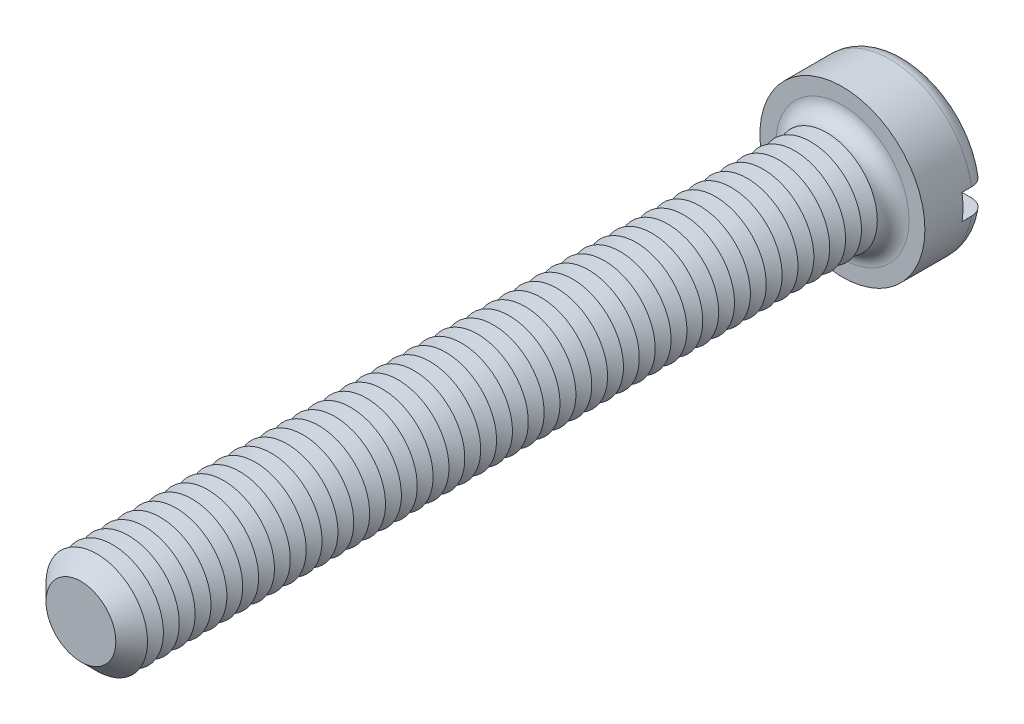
ISO-10303-21;
HEADER;
FILE_DESCRIPTION(('STEP AP214'),'2;1');
FILE_NAME('part.step','',(''),(''),'','','');
FILE_SCHEMA(('AUTOMOTIVE_DESIGN { 1 0 10303 214 1 1 1 1 }'));
ENDSEC;
DATA;
#1=APPLICATION_CONTEXT('core data for automotive mechanical design processes');
#2=APPLICATION_PROTOCOL_DEFINITION('international standard','automotive_design',2000,#1);
#3=PRODUCT_CONTEXT('',#1,'mechanical');
#4=PRODUCT('Part','Part','',(#3));
#5=PRODUCT_RELATED_PRODUCT_CATEGORY('part','',(#4));
#6=PRODUCT_DEFINITION_FORMATION('','',#4);
#7=PRODUCT_DEFINITION_CONTEXT('part definition',#1,'design');
#8=PRODUCT_DEFINITION('design','',#6,#7);
#9=PRODUCT_DEFINITION_SHAPE('','',#8);
#10=(LENGTH_UNIT() NAMED_UNIT(*) SI_UNIT(.MILLI.,.METRE.));
#11=(NAMED_UNIT(*) PLANE_ANGLE_UNIT() SI_UNIT($,.RADIAN.));
#12=(NAMED_UNIT(*) SI_UNIT($,.STERADIAN.) SOLID_ANGLE_UNIT());
#13=UNCERTAINTY_MEASURE_WITH_UNIT(LENGTH_MEASURE(1.E-05),#10,'distance_accuracy_value','');
#14=(GEOMETRIC_REPRESENTATION_CONTEXT(3) GLOBAL_UNCERTAINTY_ASSIGNED_CONTEXT((#13)) GLOBAL_UNIT_ASSIGNED_CONTEXT((#10,
#11,#12)) REPRESENTATION_CONTEXT('',''));
#15=CARTESIAN_POINT('',(0.,0.,0.));
#16=DIRECTION('',(0.,0.,1.));
#17=DIRECTION('',(1.,0.,0.));
#18=AXIS2_PLACEMENT_3D('',#15,#16,#17);
#19=CARTESIAN_POINT('',(0.,0.,-5.));
#20=DIRECTION('',(0.,0.,1.));
#21=DIRECTION('',(1.,0.,0.));
#22=AXIS2_PLACEMENT_3D('',#19,#20,#21);
#23=PLANE('',#22);
#24=CARTESIAN_POINT('',(0.,0.,-5.));
#25=DIRECTION('',(0.,0.,1.));
#26=DIRECTION('',(1.,0.,0.));
#27=AXIS2_PLACEMENT_3D('',#24,#25,#26);
#28=CIRCLE('',#27,5.25);
#29=CARTESIAN_POINT('',(-5.15388203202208,1.,-5.));
#30=VERTEX_POINT('',#29);
#31=CARTESIAN_POINT('',(5.15388203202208,1.,-5.));
#32=VERTEX_POINT('',#31);
#33=EDGE_CURVE('E116',#30,#32,#28,.F.);
#34=ORIENTED_EDGE('',*,*,#33,.T.);
#35=DIRECTION('',(1.,0.,0.));
#36=VECTOR('',#35,1.);
#37=CARTESIAN_POINT('',(-6.5,1.,-5.));
#38=LINE('',#37,#36);
#39=EDGE_CURVE('E111',#30,#32,#38,.T.);
#40=ORIENTED_EDGE('',*,*,#39,.F.);
#41=EDGE_LOOP('',(#34,#40));
#42=FACE_BOUND('',#41,.T.);
#43=ADVANCED_FACE('F39',(#42),#23,.F.);
#44=CARTESIAN_POINT('',(0.,0.,-3.75));
#45=DIRECTION('',(0.,0.,1.));
#46=DIRECTION('',(1.,0.,0.));
#47=AXIS2_PLACEMENT_3D('',#44,#45,#46);
#48=TOROIDAL_SURFACE('',#47,5.25,1.25);
#49=CARTESIAN_POINT('',(-6.04655789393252,1.,-4.63904490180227));
#50=CARTESIAN_POINT('',(-5.99546860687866,1.,-4.68885774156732));
#51=CARTESIAN_POINT('',(-5.94008472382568,1.,-4.73434760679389));
#52=CARTESIAN_POINT('',(-5.8223927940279,1.,-4.81538052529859));
#53=CARTESIAN_POINT('',(-5.7600753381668,1.,-4.85090982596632));
#54=CARTESIAN_POINT('',(-5.63044351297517,1.,-4.91100606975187));
#55=CARTESIAN_POINT('',(-5.56313479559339,1.,-4.93558519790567));
#56=CARTESIAN_POINT('',(-5.42539577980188,1.,-4.97322457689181));
#57=CARTESIAN_POINT('',(-5.35496625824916,1.,-4.98628767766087));
#58=CARTESIAN_POINT('',(-5.21212635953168,1.,-5.00070478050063));
#59=CARTESIAN_POINT('',(-5.13970265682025,1.,-5.00192674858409));
#60=CARTESIAN_POINT('',(-4.99565121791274,1.,-4.99234085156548));
#61=CARTESIAN_POINT('',(-4.92402357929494,1.,-4.98153152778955));
#62=CARTESIAN_POINT('',(-4.78274786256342,1.,-4.94801424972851));
#63=CARTESIAN_POINT('',(-4.71313137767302,1.,-4.92517296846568));
#64=CARTESIAN_POINT('',(-4.57871041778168,1.,-4.86813760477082));
#65=CARTESIAN_POINT('',(-4.51390612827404,1.,-4.83394308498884));
#66=CARTESIAN_POINT('',(-4.39095493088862,1.,-4.75508341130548));
#67=CARTESIAN_POINT('',(-4.33281197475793,1.,-4.7104120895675));
#68=CARTESIAN_POINT('',(-4.22499800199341,1.,-4.61179869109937));
#69=CARTESIAN_POINT('',(-4.17532640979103,1.,-4.55785724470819));
#70=CARTESIAN_POINT('',(-4.08677450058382,1.,-4.4431082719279));
#71=CARTESIAN_POINT('',(-4.0477350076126,1.,-4.38242369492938));
#72=CARTESIAN_POINT('',(-3.98074296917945,1.,-4.25521412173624));
#73=CARTESIAN_POINT('',(-3.95278836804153,1.,-4.18869021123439));
#74=CARTESIAN_POINT('',(-3.90959497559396,1.,-4.0537026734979));
#75=CARTESIAN_POINT('',(-3.89401985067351,1.,-3.98534663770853));
#76=CARTESIAN_POINT('',(-3.8748586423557,1.,-3.84697740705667));
#77=CARTESIAN_POINT('',(-3.87127067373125,1.,-3.7769644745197));
#78=CARTESIAN_POINT('',(-3.8761573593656,1.,-3.63892215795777));
#79=CARTESIAN_POINT('',(-3.88436651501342,1.,-3.57088319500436));
#80=CARTESIAN_POINT('',(-3.91207743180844,1.,-3.43714958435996));
#81=CARTESIAN_POINT('',(-3.93157911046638,1.,-3.37145491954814));
#82=CARTESIAN_POINT('',(-3.98125045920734,1.,-3.24411474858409));
#83=CARTESIAN_POINT('',(-4.01143761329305,1.,-3.18247607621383));
#84=CARTESIAN_POINT('',(-4.08150210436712,1.,-3.064981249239));
#85=CARTESIAN_POINT('',(-4.12138048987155,1.,-3.0091257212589));
#86=CARTESIAN_POINT('',(-4.2106718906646,1.,-2.90336353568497));
#87=CARTESIAN_POINT('',(-4.26028693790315,1.,-2.85362751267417));
#88=CARTESIAN_POINT('',(-4.36696587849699,1.,-2.76291710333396));
#89=CARTESIAN_POINT('',(-4.42403082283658,1.,-2.72194395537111));
#90=CARTESIAN_POINT('',(-4.54567957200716,1.,-2.64877280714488));
#91=CARTESIAN_POINT('',(-4.61042643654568,1.,-2.61684571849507));
#92=CARTESIAN_POINT('',(-4.74430563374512,1.,-2.56412359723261));
#93=CARTESIAN_POINT('',(-4.81343838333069,1.,-2.54332962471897));
#94=CARTESIAN_POINT('',(-4.95527237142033,1.,-2.51320471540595));
#95=CARTESIAN_POINT('',(-5.0280120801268,1.,-2.50405449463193));
#96=CARTESIAN_POINT('',(-5.17399775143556,1.,-2.49810126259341));
#97=CARTESIAN_POINT('',(-5.24724372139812,1.,-2.50129843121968));
#98=CARTESIAN_POINT('',(-5.3921014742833,1.,-2.52000776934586));
#99=CARTESIAN_POINT('',(-5.4637142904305,1.,-2.53551191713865));
#100=CARTESIAN_POINT('',(-5.60326680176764,1.,-2.57846304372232));
#101=CARTESIAN_POINT('',(-5.67120668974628,1.,-2.60590939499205));
#102=CARTESIAN_POINT('',(-5.80064060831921,1.,-2.67164926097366));
#103=CARTESIAN_POINT('',(-5.862199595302,1.,-2.7098148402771));
#104=CARTESIAN_POINT('',(-5.9779079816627,1.,-2.79608690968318));
#105=CARTESIAN_POINT('',(-6.03205795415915,1.,-2.84419263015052));
#106=CARTESIAN_POINT('',(-6.13055119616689,1.,-2.94820522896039));
#107=CARTESIAN_POINT('',(-6.17502887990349,1.,-3.00398483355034));
#108=CARTESIAN_POINT('',(-6.25384180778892,1.,-3.12230113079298));
#109=CARTESIAN_POINT('',(-6.28817779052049,1.,-3.18483733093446));
#110=CARTESIAN_POINT('',(-6.34527986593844,1.,-3.31401726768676));
#111=CARTESIAN_POINT('',(-6.36818984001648,1.,-3.38059742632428));
#112=CARTESIAN_POINT('',(-6.40240470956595,1.,-3.5166725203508));
#113=CARTESIAN_POINT('',(-6.41371067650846,1.,-3.58616718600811));
#114=CARTESIAN_POINT('',(-6.42433240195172,1.,-3.72550026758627));
#115=CARTESIAN_POINT('',(-6.4237441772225,1.,-3.79533138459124));
#116=CARTESIAN_POINT('',(-6.41082814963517,1.,-3.93391789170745));
#117=CARTESIAN_POINT('',(-6.39849757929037,1.,-4.00267302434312));
#118=CARTESIAN_POINT('',(-6.36249191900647,1.,-4.13704597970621));
#119=CARTESIAN_POINT('',(-6.33883072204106,1.,-4.20266753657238));
#120=CARTESIAN_POINT('',(-6.28088769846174,1.,-4.32897165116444));
#121=CARTESIAN_POINT('',(-6.24661890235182,1.,-4.38966015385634));
#122=CARTESIAN_POINT('',(-6.18404039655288,1.,-4.48163773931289));
#123=CARTESIAN_POINT('',(-6.15876600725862,1.,-4.51503333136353));
#124=CARTESIAN_POINT('',(-6.10500607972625,1.,-4.5791298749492));
#125=CARTESIAN_POINT('',(-6.07652056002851,1.,-4.60983084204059));
#126=CARTESIAN_POINT('',(-6.04655789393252,1.,-4.63904490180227));
#127=B_SPLINE_CURVE_WITH_KNOTS('',3,(#49,#50,#51,#52,#53,#54,#55,#56,#57,#58,#59,#60,#61,#62,
#63,#64,#65,#66,#67,#68,#69,#70,#71,#72,#73,#74,#75,#76,#77,#78,#79,#80,#81,#82,#83,#84,#85,#86,
#87,#88,#89,#90,#91,#92,#93,#94,#95,#96,#97,#98,#99,#100,#101,#102,#103,#104,#105,#106,#107,
#108,#109,#110,#111,#112,#113,#114,#115,#116,#117,#118,#119,#120,#121,#122,#123,#124,#125,#126),
.UNSPECIFIED.,.T.,.F.,(4,2,2,2,2,2,2,2,2,2,2,2,2,2,2,2,2,2,2,2,2,2,2,2,2,2,2,2,2,2,2,2,2,2,2,2,
2,2,4),(0.,0.213907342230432,0.428108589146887,0.642070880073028,0.855980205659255,
1.07227200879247,1.28859003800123,1.50735715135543,1.72613269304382,1.94503735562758,
2.16392713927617,2.37933295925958,2.59469881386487,2.80399176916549,3.01325180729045,
3.2178754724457,3.42249764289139,3.62745618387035,3.83243690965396,4.04223444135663,
4.25206160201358,4.46763253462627,4.68322399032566,4.90212226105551,5.12102372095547,
5.33978261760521,5.55853002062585,5.77477015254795,5.99099354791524,6.20398686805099,
6.41696467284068,6.62718821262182,6.83739233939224,7.0459002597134,7.25445733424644,
7.46275934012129,7.67080647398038,7.79625882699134,7.92171045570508),.UNSPECIFIED.);
#128=CARTESIAN_POINT('',(-6.42261628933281,1.,-3.74999999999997));
#129=VERTEX_POINT('',#128);
#130=EDGE_CURVE('E547',#129,#30,#127,.T.);
#131=ORIENTED_EDGE('',*,*,#130,.F.);
#132=CARTESIAN_POINT('',(0.,0.,-3.75));
#133=DIRECTION('',(0.,0.,1.));
#134=DIRECTION('',(1.,0.,0.));
#135=AXIS2_PLACEMENT_3D('',#132,#133,#134);
#136=CIRCLE('',#135,6.5);
#137=CARTESIAN_POINT('',(6.42261628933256,1.,-3.75));
#138=VERTEX_POINT('',#137);
#139=EDGE_CURVE('E125',#138,#129,#136,.T.);
#140=ORIENTED_EDGE('',*,*,#139,.F.);
#141=CARTESIAN_POINT('',(4.06944999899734,1.,-4.4133199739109));
#142=CARTESIAN_POINT('',(4.10828271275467,1.,-4.47354709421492));
#143=CARTESIAN_POINT('',(4.15233880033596,1.,-4.53047894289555));
#144=CARTESIAN_POINT('',(4.24946916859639,1.,-4.63614530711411));
#145=CARTESIAN_POINT('',(4.3025574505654,1.,-4.68486685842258));
#146=CARTESIAN_POINT('',(4.41603250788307,1.,-4.77271114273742));
#147=CARTESIAN_POINT('',(4.47640839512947,1.,-4.8118479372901));
#148=CARTESIAN_POINT('',(4.60277035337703,1.,-4.87959878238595));
#149=CARTESIAN_POINT('',(4.66875480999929,1.,-4.90821584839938));
#150=CARTESIAN_POINT('',(4.80558589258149,1.,-4.95456537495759));
#151=CARTESIAN_POINT('',(4.87649196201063,1.,-4.97212253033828));
#152=CARTESIAN_POINT('',(5.02024710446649,1.,-4.99514979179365));
#153=CARTESIAN_POINT('',(5.09309636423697,1.,-5.00061873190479));
#154=CARTESIAN_POINT('',(5.23902872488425,1.,-4.99926689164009));
#155=CARTESIAN_POINT('',(5.31211131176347,1.,-4.99238812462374));
#156=CARTESIAN_POINT('',(5.45605806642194,1.,-4.96635140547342));
#157=CARTESIAN_POINT('',(5.52692231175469,1.,-4.94719388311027));
#158=CARTESIAN_POINT('',(5.66376170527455,1.,-4.89728421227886));
#159=CARTESIAN_POINT('',(5.72977335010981,1.,-4.86663219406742));
#160=CARTESIAN_POINT('',(5.85560715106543,1.,-4.79452334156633));
#161=CARTESIAN_POINT('',(5.91542977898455,1.,-4.7530673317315));
#162=CARTESIAN_POINT('',(6.02626022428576,1.,-4.66116821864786));
#163=CARTESIAN_POINT('',(6.07738307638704,1.,-4.6108638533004));
#164=CARTESIAN_POINT('',(6.17030947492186,1.,-4.50227823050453));
#165=CARTESIAN_POINT('',(6.2121137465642,1.,-4.44399759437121));
#166=CARTESIAN_POINT('',(6.28460268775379,1.,-4.32200305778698));
#167=CARTESIAN_POINT('',(6.31543589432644,1.,-4.2583773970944));
#168=CARTESIAN_POINT('',(6.36586009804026,1.,-4.12681721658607));
#169=CARTESIAN_POINT('',(6.38545178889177,1.,-4.0588829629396));
#170=CARTESIAN_POINT('',(6.41265760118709,1.,-3.92136007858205));
#171=CARTESIAN_POINT('',(6.42038873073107,1.,-3.85179457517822));
#172=CARTESIAN_POINT('',(6.42401070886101,1.,-3.7123569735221));
#173=CARTESIAN_POINT('',(6.41990193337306,1.,-3.64248488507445));
#174=CARTESIAN_POINT('',(6.40000894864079,1.,-3.50470871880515));
#175=CARTESIAN_POINT('',(6.38427119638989,1.,-3.43679792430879));
#176=CARTESIAN_POINT('',(6.34164491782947,1.,-3.30457296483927));
#177=CARTESIAN_POINT('',(6.31475638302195,1.,-3.24025880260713));
#178=CARTESIAN_POINT('',(6.2505455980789,1.,-3.11686791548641));
#179=CARTESIAN_POINT('',(6.21319759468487,1.,-3.05780459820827));
#180=CARTESIAN_POINT('',(6.12919411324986,1.,-2.94671919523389));
#181=CARTESIAN_POINT('',(6.08253833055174,1.,-2.89469734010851));
#182=CARTESIAN_POINT('',(5.98083387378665,1.,-2.79868150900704));
#183=CARTESIAN_POINT('',(5.92571704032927,1.,-2.75475975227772));
#184=CARTESIAN_POINT('',(5.80897194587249,1.,-2.67665277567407));
#185=CARTESIAN_POINT('',(5.74734329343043,1.,-2.64246814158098));
#186=CARTESIAN_POINT('',(5.6184644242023,1.,-2.58431810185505));
#187=CARTESIAN_POINT('',(5.55115102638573,1.,-2.56049275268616));
#188=CARTESIAN_POINT('',(5.41351272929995,1.,-2.52429868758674));
#189=CARTESIAN_POINT('',(5.34318759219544,1.,-2.51193087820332));
#190=CARTESIAN_POINT('',(5.20041507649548,1.,-2.49882112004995));
#191=CARTESIAN_POINT('',(5.12795169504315,1.,-2.49825332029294));
#192=CARTESIAN_POINT('',(4.98393373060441,1.,-2.50914771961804));
#193=CARTESIAN_POINT('',(4.91237921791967,1.,-2.52061084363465));
#194=CARTESIAN_POINT('',(4.77137358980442,1.,-2.55542281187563));
#195=CARTESIAN_POINT('',(4.70195472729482,1.,-2.57890245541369));
#196=CARTESIAN_POINT('',(4.56803538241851,1.,-2.63717701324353));
#197=CARTESIAN_POINT('',(4.50353509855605,1.,-2.67197238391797));
#198=CARTESIAN_POINT('',(4.38131858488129,1.,-2.7519648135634));
#199=CARTESIAN_POINT('',(4.32360365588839,1.,-2.79716386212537));
#200=CARTESIAN_POINT('',(4.21673400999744,1.,-2.89675634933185));
#201=CARTESIAN_POINT('',(4.16757871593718,1.,-2.95114916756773));
#202=CARTESIAN_POINT('',(4.08014713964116,1.,-3.06667703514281));
#203=CARTESIAN_POINT('',(4.04170608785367,1.,-3.12768727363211));
#204=CARTESIAN_POINT('',(3.97596192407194,1.,-3.25543782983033));
#205=CARTESIAN_POINT('',(3.94865624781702,1.,-3.32217682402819));
#206=CARTESIAN_POINT('',(3.9067737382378,1.,-3.45745603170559));
#207=CARTESIAN_POINT('',(3.89185707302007,1.,-3.52589108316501));
#208=CARTESIAN_POINT('',(3.87400755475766,1.,-3.66432360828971));
#209=CARTESIAN_POINT('',(3.87107601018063,1.,-3.73432125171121));
#210=CARTESIAN_POINT('',(3.8772387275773,1.,-3.87228267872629));
#211=CARTESIAN_POINT('',(3.88607933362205,1.,-3.94025811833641));
#212=CARTESIAN_POINT('',(3.91502769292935,1.,-4.07370133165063));
#213=CARTESIAN_POINT('',(3.93512131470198,1.,-4.1391721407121));
#214=CARTESIAN_POINT('',(3.9752037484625,1.,-4.23926719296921));
#215=CARTESIAN_POINT('',(3.99171171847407,1.,-4.27532618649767));
#216=CARTESIAN_POINT('',(4.02809737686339,1.,-4.34569933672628));
#217=CARTESIAN_POINT('',(4.04797497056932,1.,-4.3800135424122));
#218=CARTESIAN_POINT('',(4.06944999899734,1.,-4.4133199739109));
#219=B_SPLINE_CURVE_WITH_KNOTS('',3,(#141,#142,#143,#144,#145,#146,#147,#148,#149,#150,#151,
#152,#153,#154,#155,#156,#157,#158,#159,#160,#161,#162,#163,#164,#165,#166,#167,#168,#169,#170,
#171,#172,#173,#174,#175,#176,#177,#178,#179,#180,#181,#182,#183,#184,#185,#186,#187,#188,#189,
#190,#191,#192,#193,#194,#195,#196,#197,#198,#199,#200,#201,#202,#203,#204,#205,#206,#207,#208,
#209,#210,#211,#212,#213,#214,#215,#216,#217,#218),.UNSPECIFIED.,.T.,.F.,(4,2,2,2,2,2,2,2,2,2,2,
2,2,2,2,2,2,2,2,2,2,2,2,2,2,2,2,2,2,2,2,2,2,2,2,2,2,2,4),(0.,0.214833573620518,
0.430003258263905,0.644855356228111,0.859645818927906,1.0777603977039,1.29589601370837,
1.51505870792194,1.73421373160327,1.95150241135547,2.16877451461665,2.38290237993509,
2.59701357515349,2.8081044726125,3.01918234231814,3.22816416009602,3.43713934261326,
3.64528416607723,3.85342914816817,4.06209119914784,4.27076008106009,4.48120788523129,
4.69166834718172,4.90489186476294,5.11813225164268,5.33451752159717,5.55091942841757,
5.76972860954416,5.98854661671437,6.20740650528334,6.42625163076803,6.64151774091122,
6.85673425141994,7.0658317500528,7.27495207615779,7.47963858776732,7.68406862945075,
7.80287790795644,7.92168384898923),.UNSPECIFIED.);
#220=EDGE_CURVE('E549',#32,#138,#219,.T.);
#221=ORIENTED_EDGE('',*,*,#220,.F.);
#222=ORIENTED_EDGE('',*,*,#33,.F.);
#223=EDGE_LOOP('',(#131,#140,#221,#222));
#224=FACE_BOUND('',#223,.T.);
#225=ADVANCED_FACE('F531',(#224),#48,.T.);
#226=CARTESIAN_POINT('',(0.,0.,-5.));
#227=DIRECTION('',(0.,0.,1.));
#228=DIRECTION('',(1.,0.,0.));
#229=AXIS2_PLACEMENT_3D('',#226,#227,#228);
#230=CYLINDRICAL_SURFACE('',#229,6.5);
#231=DIRECTION('',(0.,0.,1.));
#232=VECTOR('',#231,1.);
#233=CARTESIAN_POINT('',(6.42261628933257,1.,-5.));
#234=LINE('',#233,#232);
#235=CARTESIAN_POINT('',(6.42261628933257,1.,-3.));
#236=VERTEX_POINT('',#235);
#237=EDGE_CURVE('E564',#138,#236,#234,.T.);
#238=ORIENTED_EDGE('',*,*,#237,.F.);
#239=ORIENTED_EDGE('',*,*,#139,.T.);
#240=DIRECTION('',(0.,0.,1.));
#241=VECTOR('',#240,1.);
#242=CARTESIAN_POINT('',(-6.42261628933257,1.,-5.));
#243=LINE('',#242,#241);
#244=CARTESIAN_POINT('',(-6.42261628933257,1.,-3.));
#245=VERTEX_POINT('',#244);
#246=EDGE_CURVE('E63',#245,#129,#243,.F.);
#247=ORIENTED_EDGE('',*,*,#246,.F.);
#248=CARTESIAN_POINT('',(0.,0.,-3.));
#249=DIRECTION('',(0.,0.,-1.));
#250=DIRECTION('',(-1.,0.,0.));
#251=AXIS2_PLACEMENT_3D('',#248,#249,#250);
#252=CIRCLE('',#251,6.5);
#253=CARTESIAN_POINT('',(-6.42261628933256,-0.999999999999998,-3.));
#254=VERTEX_POINT('',#253);
#255=EDGE_CURVE('E43',#245,#254,#252,.F.);
#256=ORIENTED_EDGE('',*,*,#255,.T.);
#257=DIRECTION('',(0.,0.,1.));
#258=VECTOR('',#257,1.);
#259=CARTESIAN_POINT('',(-6.42261628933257,-0.999999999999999,-5.));
#260=LINE('',#259,#258);
#261=CARTESIAN_POINT('',(-6.42261628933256,-0.999999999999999,-3.75));
#262=VERTEX_POINT('',#261);
#263=EDGE_CURVE('E561',#262,#254,#260,.T.);
#264=ORIENTED_EDGE('',*,*,#263,.F.);
#265=CARTESIAN_POINT('',(6.42261628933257,-1.,-3.75));
#266=VERTEX_POINT('',#265);
#267=EDGE_CURVE('E127',#262,#266,#136,.T.);
#268=ORIENTED_EDGE('',*,*,#267,.T.);
#269=DIRECTION('',(0.,0.,1.));
#270=VECTOR('',#269,1.);
#271=CARTESIAN_POINT('',(6.42261628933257,-1.,-5.));
#272=LINE('',#271,#270);
#273=CARTESIAN_POINT('',(6.42261628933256,-1.,-3.));
#274=VERTEX_POINT('',#273);
#275=EDGE_CURVE('E55',#274,#266,#272,.F.);
#276=ORIENTED_EDGE('',*,*,#275,.F.);
#277=EDGE_CURVE('E11',#274,#236,#252,.F.);
#278=ORIENTED_EDGE('',*,*,#277,.T.);
#279=EDGE_LOOP('',(#238,#239,#247,#256,#264,#268,#276,#278));
#280=FACE_BOUND('',#279,.T.);
#281=CARTESIAN_POINT('',(0.,0.,0.));
#282=DIRECTION('',(0.,0.,1.));
#283=DIRECTION('',(1.,0.,0.));
#284=AXIS2_PLACEMENT_3D('',#281,#282,#283);
#285=CIRCLE('',#284,6.5);
#286=CARTESIAN_POINT('',(6.5,0.,0.));
#287=VERTEX_POINT('',#286);
#288=EDGE_CURVE('E567',#287,#287,#285,.T.);
#289=ORIENTED_EDGE('',*,*,#288,.F.);
#290=EDGE_LOOP('',(#289));
#291=FACE_BOUND('',#290,.T.);
#292=ADVANCED_FACE('F527',(#280,#291),#230,.T.);
#293=CARTESIAN_POINT('',(5.15388203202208,-1.,-5.));
#294=VERTEX_POINT('',#293);
#295=CARTESIAN_POINT('',(-5.15388203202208,-0.999999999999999,-5.));
#296=VERTEX_POINT('',#295);
#297=EDGE_CURVE('E109',#294,#296,#28,.F.);
#298=ORIENTED_EDGE('',*,*,#297,.T.);
#299=DIRECTION('',(-1.,0.,0.));
#300=VECTOR('',#299,1.);
#301=CARTESIAN_POINT('',(-6.5,-0.999999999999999,-5.));
#302=LINE('',#301,#300);
#303=EDGE_CURVE('E96',#294,#296,#302,.T.);
#304=ORIENTED_EDGE('',*,*,#303,.F.);
#305=EDGE_LOOP('',(#298,#304));
#306=FACE_BOUND('',#305,.T.);
#307=ADVANCED_FACE('F108',(#306),#23,.F.);
#308=CARTESIAN_POINT('',(0.,0.,0.));
#309=DIRECTION('',(0.,0.,1.));
#310=DIRECTION('',(1.,0.,0.));
#311=AXIS2_PLACEMENT_3D('',#308,#309,#310);
#312=PLANE('',#311);
#313=CARTESIAN_POINT('',(0.,0.,0.));
#314=DIRECTION('',(0.,0.,1.));
#315=DIRECTION('',(1.,0.,0.));
#316=AXIS2_PLACEMENT_3D('',#313,#314,#315);
#317=CIRCLE('',#316,5.25);
#318=CARTESIAN_POINT('',(5.25,0.,0.));
#319=VERTEX_POINT('',#318);
#320=EDGE_CURVE('E115',#319,#319,#317,.F.);
#321=ORIENTED_EDGE('',*,*,#320,.T.);
#322=EDGE_LOOP('',(#321));
#323=FACE_BOUND('',#322,.T.);
#324=ORIENTED_EDGE('',*,*,#288,.T.);
#325=EDGE_LOOP('',(#324));
#326=FACE_BOUND('',#325,.T.);
#327=ADVANCED_FACE('F526',(#323,#326),#312,.T.);
#328=CARTESIAN_POINT('',(-6.04655789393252,-0.999999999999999,-4.63904490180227));
#329=CARTESIAN_POINT('',(-6.0966604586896,-0.999999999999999,-4.59018532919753));
#330=CARTESIAN_POINT('',(-6.14270501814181,-0.999999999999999,-4.53709744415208));
#331=CARTESIAN_POINT('',(-6.22528519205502,-0.999999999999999,-4.42391631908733));
#332=CARTESIAN_POINT('',(-6.26181074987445,-0.999999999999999,-4.36381576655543));
#333=CARTESIAN_POINT('',(-6.32422109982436,-0.999999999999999,-4.23831836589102));
#334=CARTESIAN_POINT('',(-6.35010658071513,-0.999999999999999,-4.17292186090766));
#335=CARTESIAN_POINT('',(-6.39044668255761,-0.999999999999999,-4.03870925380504));
#336=CARTESIAN_POINT('',(-6.40490396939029,-0.999999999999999,-3.96989395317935));
#337=CARTESIAN_POINT('',(-6.42190814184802,-0.999999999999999,-3.83122595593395));
#338=CARTESIAN_POINT('',(-6.4245257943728,-0.999999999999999,-3.76138193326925));
#339=CARTESIAN_POINT('',(-6.41796432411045,-0.999999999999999,-3.62224935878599));
#340=CARTESIAN_POINT('',(-6.40878509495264,-0.999999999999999,-3.55296081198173));
#341=CARTESIAN_POINT('',(-6.37894560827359,-0.999999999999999,-3.41709241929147));
#342=CARTESIAN_POINT('',(-6.35831520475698,-0.999999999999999,-3.35050601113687));
#343=CARTESIAN_POINT('',(-6.30620980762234,-0.999999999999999,-3.22172312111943));
#344=CARTESIAN_POINT('',(-6.2747347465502,-0.999999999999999,-3.15952666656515));
#345=CARTESIAN_POINT('',(-6.20172710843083,-0.999999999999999,-3.04101762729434));
#346=CARTESIAN_POINT('',(-6.16015622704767,-0.999999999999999,-2.98472864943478));
#347=CARTESIAN_POINT('',(-6.06823774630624,-0.999999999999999,-2.87984578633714));
#348=CARTESIAN_POINT('',(-6.01788981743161,-0.999999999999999,-2.83125219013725));
#349=CARTESIAN_POINT('',(-5.90933830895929,-0.999999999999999,-2.74262118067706));
#350=CARTESIAN_POINT('',(-5.85106338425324,-0.999999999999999,-2.70267117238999));
#351=CARTESIAN_POINT('',(-5.72870702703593,-0.999999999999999,-2.63296796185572));
#352=CARTESIAN_POINT('',(-5.66462521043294,-0.999999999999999,-2.6032154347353));
#353=CARTESIAN_POINT('',(-5.53153273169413,-0.999999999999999,-2.55430842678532));
#354=CARTESIAN_POINT('',(-5.46246626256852,-0.999999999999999,-2.53530583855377));
#355=CARTESIAN_POINT('',(-5.32214267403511,-0.999999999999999,-2.5089831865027));
#356=CARTESIAN_POINT('',(-5.25088537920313,-0.999999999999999,-2.50166406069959));
#357=CARTESIAN_POINT('',(-5.10710123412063,-0.999999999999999,-2.49882202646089));
#358=CARTESIAN_POINT('',(-5.03457095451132,-0.999999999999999,-2.50347166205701));
#359=CARTESIAN_POINT('',(-4.8912897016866,-0.999999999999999,-2.52476029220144));
#360=CARTESIAN_POINT('',(-4.82053886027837,-0.999999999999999,-2.54140017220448));
#361=CARTESIAN_POINT('',(-4.68213257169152,-0.999999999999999,-2.58641614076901));
#362=CARTESIAN_POINT('',(-4.61451256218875,-0.999999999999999,-2.61490131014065));
#363=CARTESIAN_POINT('',(-4.48502801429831,-0.999999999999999,-2.68285095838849));
#364=CARTESIAN_POINT('',(-4.42316359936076,-0.999999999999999,-2.72231567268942));
#365=CARTESIAN_POINT('',(-4.30720694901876,-0.999999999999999,-2.81103994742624));
#366=CARTESIAN_POINT('',(-4.25309118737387,-0.999999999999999,-2.86026872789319));
#367=CARTESIAN_POINT('',(-4.15409408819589,-0.999999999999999,-2.9672764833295));
#368=CARTESIAN_POINT('',(-4.10921182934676,-0.999999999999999,-3.02505460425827));
#369=CARTESIAN_POINT('',(-4.03096584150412,-0.999999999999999,-3.14632492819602));
#370=CARTESIAN_POINT('',(-3.99739097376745,-0.999999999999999,-3.2096807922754));
#371=CARTESIAN_POINT('',(-3.94171839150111,-0.999999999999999,-3.34124912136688));
#372=CARTESIAN_POINT('',(-3.91961840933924,-0.999999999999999,-3.40946062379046));
#373=CARTESIAN_POINT('',(-3.88816636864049,-0.999999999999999,-3.54669256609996));
#374=CARTESIAN_POINT('',(-3.87846562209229,-0.999999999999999,-3.61563318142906));
#375=CARTESIAN_POINT('',(-3.87100568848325,-0.999999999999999,-3.75415397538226));
#376=CARTESIAN_POINT('',(-3.87324501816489,-0.999999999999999,-3.82373407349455));
#377=CARTESIAN_POINT('',(-3.88943589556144,-0.999999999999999,-3.96027701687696));
#378=CARTESIAN_POINT('',(-3.90318225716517,-0.999999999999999,-4.0272643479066));
#379=CARTESIAN_POINT('',(-3.94163954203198,-0.999999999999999,-4.1580093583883));
#380=CARTESIAN_POINT('',(-3.96635075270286,-0.999999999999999,-4.22176695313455));
#381=CARTESIAN_POINT('',(-4.026160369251,-0.999999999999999,-4.34483320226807));
#382=CARTESIAN_POINT('',(-4.06134035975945,-0.999999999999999,-4.40410214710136));
#383=CARTESIAN_POINT('',(-4.14090865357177,-0.999999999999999,-4.51609417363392));
#384=CARTESIAN_POINT('',(-4.18529811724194,-0.999999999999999,-4.56881642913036));
#385=CARTESIAN_POINT('',(-4.2832649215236,-0.999999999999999,-4.66770177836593));
#386=CARTESIAN_POINT('',(-4.33705327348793,-0.999999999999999,-4.71365579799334));
#387=CARTESIAN_POINT('',(-4.45141776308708,-0.999999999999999,-4.79615385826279));
#388=CARTESIAN_POINT('',(-4.51199483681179,-0.999999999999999,-4.83269659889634));
#389=CARTESIAN_POINT('',(-4.63989216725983,-0.999999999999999,-4.89626962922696));
#390=CARTESIAN_POINT('',(-4.70734508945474,-0.999999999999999,-4.92303326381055));
#391=CARTESIAN_POINT('',(-4.84575497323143,-0.999999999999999,-4.96500199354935));
#392=CARTESIAN_POINT('',(-4.91671207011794,-0.999999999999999,-4.98020664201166));
#393=CARTESIAN_POINT('',(-5.06097761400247,-0.999999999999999,-4.9987306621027));
#394=CARTESIAN_POINT('',(-5.13430353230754,-0.999999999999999,-5.00191441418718));
#395=CARTESIAN_POINT('',(-5.28046546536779,-0.999999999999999,-4.99587686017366));
#396=CARTESIAN_POINT('',(-5.35330135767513,-0.999999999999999,-4.98665256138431));
#397=CARTESIAN_POINT('',(-5.49610354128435,-0.999999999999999,-4.95604184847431));
#398=CARTESIAN_POINT('',(-5.56607890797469,-0.999999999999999,-4.93469772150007));
#399=CARTESIAN_POINT('',(-5.70131538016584,-0.999999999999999,-4.88041956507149));
#400=CARTESIAN_POINT('',(-5.76658233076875,-0.999999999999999,-4.84750021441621));
#401=CARTESIAN_POINT('',(-5.86782577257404,-0.999999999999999,-4.78498748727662));
#402=CARTESIAN_POINT('',(-5.90579749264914,-0.999999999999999,-4.75856648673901));
#403=CARTESIAN_POINT('',(-5.97862186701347,-0.999999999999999,-4.70172646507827));
#404=CARTESIAN_POINT('',(-6.0134745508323,-0.999999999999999,-4.6713074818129));
#405=CARTESIAN_POINT('',(-6.04655789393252,-0.999999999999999,-4.63904490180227));
#406=B_SPLINE_CURVE_WITH_KNOTS('',3,(#328,#329,#330,#331,#332,#333,#334,#335,#336,#337,#338,
#339,#340,#341,#342,#343,#344,#345,#346,#347,#348,#349,#350,#351,#352,#353,#354,#355,#356,#357,
#358,#359,#360,#361,#362,#363,#364,#365,#366,#367,#368,#369,#370,#371,#372,#373,#374,#375,#376,
#377,#378,#379,#380,#381,#382,#383,#384,#385,#386,#387,#388,#389,#390,#391,#392,#393,#394,#395,
#396,#397,#398,#399,#400,#401,#402,#403,#404,#405),.UNSPECIFIED.,.T.,.F.,(4,2,2,2,2,2,2,2,2,2,2,
2,2,2,2,2,2,2,2,2,2,2,2,2,2,2,2,2,2,2,2,2,2,2,2,2,2,2,4),(0.,0.209780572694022,
0.419781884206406,0.629769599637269,0.839708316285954,1.04839053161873,1.2570746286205,
1.46521720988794,1.67336108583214,1.88230736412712,2.09126148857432,2.30223890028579,
2.51323027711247,2.72713284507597,2.94105258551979,3.15807345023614,3.37511034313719,
3.59419176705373,3.81327788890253,4.03168404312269,4.25006839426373,4.46411376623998,
4.67811682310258,4.88595885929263,5.09377507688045,5.29796268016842,5.50215563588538,
5.70798353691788,5.91383738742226,6.12510741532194,6.33640661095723,6.55309998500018,
6.76980173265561,6.98894112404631,7.20813337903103,7.42656551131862,7.64472163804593,
7.78324365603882,7.92176436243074),.UNSPECIFIED.);
#407=EDGE_CURVE('E103',#296,#262,#406,.T.);
#408=ORIENTED_EDGE('',*,*,#407,.F.);
#409=ORIENTED_EDGE('',*,*,#297,.F.);
#410=CARTESIAN_POINT('',(4.06944999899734,-1.,-4.4133199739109));
#411=CARTESIAN_POINT('',(4.03213207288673,-1.,-4.3554312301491));
#412=CARTESIAN_POINT('',(3.9995849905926,-1.,-4.29441722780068));
#413=CARTESIAN_POINT('',(3.94511822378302,-1.,-4.16776604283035));
#414=CARTESIAN_POINT('',(3.92320762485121,-1.,-4.10212496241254));
#415=CARTESIAN_POINT('',(3.89078811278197,-1.,-3.96804412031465));
#416=CARTESIAN_POINT('',(3.88028409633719,-1.,-3.89960316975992));
#417=CARTESIAN_POINT('',(3.87107895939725,-1.,-3.76194650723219));
#418=CARTESIAN_POINT('',(3.87237511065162,-1.,-3.69273097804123));
#419=CARTESIAN_POINT('',(3.88662927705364,-1.,-3.55634460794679));
#420=CARTESIAN_POINT('',(3.89944923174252,-1.,-3.48915926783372));
#421=CARTESIAN_POINT('',(3.93611188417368,-1.,-3.35786953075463));
#422=CARTESIAN_POINT('',(3.95995518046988,-1.,-3.29376530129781));
#423=CARTESIAN_POINT('',(4.0180748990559,-1.,-3.16993562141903));
#424=CARTESIAN_POINT('',(4.05242297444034,-1.,-3.11024385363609));
#425=CARTESIAN_POINT('',(4.13041121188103,-1.,-2.9972793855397));
#426=CARTESIAN_POINT('',(4.17405248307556,-1.,-2.94400745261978));
#427=CARTESIAN_POINT('',(4.27058636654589,-1.,-2.8439150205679));
#428=CARTESIAN_POINT('',(4.32368948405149,-1.,-2.79729757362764));
#429=CARTESIAN_POINT('',(4.43679856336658,-1.,-2.71336600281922));
#430=CARTESIAN_POINT('',(4.49680546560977,-1.,-2.67605314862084));
#431=CARTESIAN_POINT('',(4.62370121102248,-1.,-2.61081752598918));
#432=CARTESIAN_POINT('',(4.69072799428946,-1.,-2.58316284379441));
#433=CARTESIAN_POINT('',(4.82843981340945,-1.,-2.5393441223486));
#434=CARTESIAN_POINT('',(4.899125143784,-1.,-2.52318100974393));
#435=CARTESIAN_POINT('',(5.04306377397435,-1.,-2.50267755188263));
#436=CARTESIAN_POINT('',(5.11633773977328,-1.,-2.49848181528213));
#437=CARTESIAN_POINT('',(5.26254809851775,-1.,-2.50249357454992));
#438=CARTESIAN_POINT('',(5.33548449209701,-1.,-2.51070104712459));
#439=CARTESIAN_POINT('',(5.4786703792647,-1.,-2.53930888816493));
#440=CARTESIAN_POINT('',(5.54892819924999,-1.,-2.5596675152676));
#441=CARTESIAN_POINT('',(5.68495799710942,-1.,-2.61204238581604));
#442=CARTESIAN_POINT('',(5.75073024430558,-1.,-2.64405792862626));
#443=CARTESIAN_POINT('',(5.8750178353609,-1.,-2.7184150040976));
#444=CARTESIAN_POINT('',(5.93361487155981,-1.,-2.76061995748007));
#445=CARTESIAN_POINT('',(6.04275377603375,-1.,-2.85440601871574));
#446=CARTESIAN_POINT('',(6.09329629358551,-1.,-2.90598637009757));
#447=CARTESIAN_POINT('',(6.18409572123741,-1.,-3.01622977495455));
#448=CARTESIAN_POINT('',(6.2244945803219,-1.,-3.07477592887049));
#449=CARTESIAN_POINT('',(6.29474798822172,-1.,-3.19788594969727));
#450=CARTESIAN_POINT('',(6.3246032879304,-1.,-3.26244938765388));
#451=CARTESIAN_POINT('',(6.37256001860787,-1.,-3.39491634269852));
#452=CARTESIAN_POINT('',(6.39079949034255,-1.,-3.46276990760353));
#453=CARTESIAN_POINT('',(6.41554133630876,-1.,-3.60058363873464));
#454=CARTESIAN_POINT('',(6.42204424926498,-1.,-3.67054370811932));
#455=CARTESIAN_POINT('',(6.42311237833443,-1.,-3.81007982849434));
#456=CARTESIAN_POINT('',(6.41775799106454,-1.,-3.879655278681));
#457=CARTESIAN_POINT('',(6.39543799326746,-1.,-4.01691664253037));
#458=CARTESIAN_POINT('',(6.3784725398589,-1.,-4.08460258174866));
#459=CARTESIAN_POINT('',(6.33344768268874,-1.,-4.21614537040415));
#460=CARTESIAN_POINT('',(6.30539273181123,-1.,-4.28000374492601));
#461=CARTESIAN_POINT('',(6.23902076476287,-1.,-4.40214140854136));
#462=CARTESIAN_POINT('',(6.20070356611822,-1.,-4.46042059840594));
#463=CARTESIAN_POINT('',(6.11467174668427,-1.,-4.5701315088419));
#464=CARTESIAN_POINT('',(6.06690270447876,-1.,-4.62152053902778));
#465=CARTESIAN_POINT('',(5.96350111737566,-1.,-4.715657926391));
#466=CARTESIAN_POINT('',(5.90786817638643,-1.,-4.75840584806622));
#467=CARTESIAN_POINT('',(5.78965380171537,-1.,-4.8345781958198));
#468=CARTESIAN_POINT('',(5.72700078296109,-1.,-4.86789149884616));
#469=CARTESIAN_POINT('',(5.59704977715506,-1.,-4.92369754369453));
#470=CARTESIAN_POINT('',(5.52975144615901,-1.,-4.94618948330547));
#471=CARTESIAN_POINT('',(5.39137621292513,-1.,-4.98006173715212));
#472=CARTESIAN_POINT('',(5.32025859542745,-1.,-4.99127571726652));
#473=CARTESIAN_POINT('',(5.17715081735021,-1.,-5.00177798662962));
#474=CARTESIAN_POINT('',(5.10516061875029,-1.,-5.00106575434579));
#475=CARTESIAN_POINT('',(4.96131924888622,-1.,-4.98769775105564));
#476=CARTESIAN_POINT('',(4.88948297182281,-1.,-4.97488146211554));
#477=CARTESIAN_POINT('',(4.74893184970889,-1.,-4.93744335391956));
#478=CARTESIAN_POINT('',(4.68021795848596,-1.,-4.91281795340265));
#479=CARTESIAN_POINT('',(4.54744428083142,-1.,-4.8522329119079));
#480=CARTESIAN_POINT('',(4.48341761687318,-1.,-4.81620070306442));
#481=CARTESIAN_POINT('',(4.36244497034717,-1.,-4.73383277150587));
#482=CARTESIAN_POINT('',(4.30549069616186,-1.,-4.68750929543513));
#483=CARTESIAN_POINT('',(4.21823158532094,-1.,-4.60311228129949));
#484=CARTESIAN_POINT('',(4.18544074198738,-1.,-4.56757118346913));
#485=CARTESIAN_POINT('',(4.12413461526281,-1.,-4.49297229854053));
#486=CARTESIAN_POINT('',(4.09561926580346,-1.,-4.45391456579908));
#487=CARTESIAN_POINT('',(4.06944999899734,-1.,-4.4133199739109));
#488=B_SPLINE_CURVE_WITH_KNOTS('',3,(#410,#411,#412,#413,#414,#415,#416,#417,#418,#419,#420,
#421,#422,#423,#424,#425,#426,#427,#428,#429,#430,#431,#432,#433,#434,#435,#436,#437,#438,#439,
#440,#441,#442,#443,#444,#445,#446,#447,#448,#449,#450,#451,#452,#453,#454,#455,#456,#457,#458,
#459,#460,#461,#462,#463,#464,#465,#466,#467,#468,#469,#470,#471,#472,#473,#474,#475,#476,#477,
#478,#479,#480,#481,#482,#483,#484,#485,#486,#487),.UNSPECIFIED.,.T.,.F.,(4,2,2,2,2,2,2,2,2,2,2,
2,2,2,2,2,2,2,2,2,2,2,2,2,2,2,2,2,2,2,2,2,2,2,2,2,2,2,4),(0.,0.206453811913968,0.4130836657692,
0.619802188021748,0.826472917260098,1.03070015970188,1.23493849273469,1.44060223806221,
1.64629054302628,1.85731119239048,2.06836062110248,2.28487349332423,2.5014038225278,
2.72053974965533,2.9396752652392,3.15806230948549,3.37643622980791,3.59203140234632,
3.80760918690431,4.01997696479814,4.23232961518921,4.44210913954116,4.65187903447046,
4.86023097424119,5.06858009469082,5.27684563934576,5.48511488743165,5.69462015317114,
5.90413597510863,6.11602561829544,6.32793096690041,6.54291770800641,6.75791385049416,
6.97580180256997,7.19375587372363,7.41312537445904,7.63223520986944,7.77701357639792,
7.92178970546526),.UNSPECIFIED.);
#489=EDGE_CURVE('E92',#266,#294,#488,.T.);
#490=ORIENTED_EDGE('',*,*,#489,.F.);
#491=ORIENTED_EDGE('',*,*,#267,.F.);
#492=EDGE_LOOP('',(#408,#409,#490,#491));
#493=FACE_BOUND('',#492,.T.);
#494=ADVANCED_FACE('F113',(#493),#48,.T.);
#495=CARTESIAN_POINT('',(0.,0.,1.25));
#496=DIRECTION('',(0.,0.,1.));
#497=DIRECTION('',(1.,0.,0.));
#498=AXIS2_PLACEMENT_3D('',#495,#496,#497);
#499=TOROIDAL_SURFACE('',#498,5.25,1.25);
#500=ORIENTED_EDGE('',*,*,#320,.F.);
#501=EDGE_LOOP('',(#500));
#502=FACE_BOUND('',#501,.T.);
#503=CARTESIAN_POINT('',(0.,0.,1.25));
#504=DIRECTION('',(0.,0.,-1.));
#505=DIRECTION('',(-1.,0.,0.));
#506=AXIS2_PLACEMENT_3D('',#503,#504,#505);
#507=CIRCLE('',#506,4.);
#508=CARTESIAN_POINT('',(-4.,0.,1.25));
#509=VERTEX_POINT('',#508);
#510=EDGE_CURVE('E573',#509,#509,#507,.T.);
#511=ORIENTED_EDGE('',*,*,#510,.T.);
#512=EDGE_LOOP('',(#511));
#513=FACE_BOUND('',#512,.T.);
#514=ADVANCED_FACE('F519',(#502,#513),#499,.F.);
#515=CARTESIAN_POINT('',(0.,0.,1.875));
#516=DIRECTION('',(0.,0.,-1.));
#517=DIRECTION('',(-1.,0.,0.));
#518=AXIS2_PLACEMENT_3D('',#515,#516,#517);
#519=CONICAL_SURFACE('',#518,2.91746824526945,1.0471975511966);
#520=ORIENTED_EDGE('',*,*,#510,.F.);
#521=EDGE_LOOP('',(#520));
#522=FACE_BOUND('',#521,.T.);
#523=CARTESIAN_POINT('',(0.,0.,1.875));
#524=DIRECTION('',(0.,0.,-1.));
#525=DIRECTION('',(-1.,0.,0.));
#526=AXIS2_PLACEMENT_3D('',#523,#524,#525);
#527=CIRCLE('',#526,2.91746824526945);
#528=CARTESIAN_POINT('',(-2.91746824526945,0.,1.875));
#529=VERTEX_POINT('',#528);
#530=EDGE_CURVE('E579',#529,#529,#527,.T.);
#531=ORIENTED_EDGE('',*,*,#530,.T.);
#532=EDGE_LOOP('',(#531));
#533=FACE_BOUND('',#532,.T.);
#534=ADVANCED_FACE('F515',(#522,#533),#519,.T.);
#535=CARTESIAN_POINT('',(0.,0.,2.5));
#536=DIRECTION('',(0.,0.,1.));
#537=DIRECTION('',(1.,0.,0.));
#538=AXIS2_PLACEMENT_3D('',#535,#536,#537);
#539=CONICAL_SURFACE('',#538,4.,1.0471975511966);
#540=ORIENTED_EDGE('',*,*,#530,.F.);
#541=EDGE_LOOP('',(#540));
#542=FACE_BOUND('',#541,.T.);
#543=CARTESIAN_POINT('',(0.,0.,2.5));
#544=DIRECTION('',(0.,0.,-1.));
#545=DIRECTION('',(-1.,0.,0.));
#546=AXIS2_PLACEMENT_3D('',#543,#544,#545);
#547=CIRCLE('',#546,4.);
#548=CARTESIAN_POINT('',(-4.,0.,2.5));
#549=VERTEX_POINT('',#548);
#550=EDGE_CURVE('E585',#549,#549,#547,.T.);
#551=ORIENTED_EDGE('',*,*,#550,.T.);
#552=EDGE_LOOP('',(#551));
#553=FACE_BOUND('',#552,.T.);
#554=ADVANCED_FACE('F511',(#542,#553),#539,.T.);
#555=CARTESIAN_POINT('',(0.,0.,3.125));
#556=DIRECTION('',(0.,0.,-1.));
#557=DIRECTION('',(-1.,0.,0.));
#558=AXIS2_PLACEMENT_3D('',#555,#556,#557);
#559=CONICAL_SURFACE('',#558,2.91746824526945,1.0471975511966);
#560=ORIENTED_EDGE('',*,*,#550,.F.);
#561=EDGE_LOOP('',(#560));
#562=FACE_BOUND('',#561,.T.);
#563=CARTESIAN_POINT('',(0.,0.,3.125));
#564=DIRECTION('',(0.,0.,-1.));
#565=DIRECTION('',(-1.,0.,0.));
#566=AXIS2_PLACEMENT_3D('',#563,#564,#565);
#567=CIRCLE('',#566,2.91746824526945);
#568=CARTESIAN_POINT('',(-2.91746824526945,0.,3.125));
#569=VERTEX_POINT('',#568);
#570=EDGE_CURVE('E588',#569,#569,#567,.T.);
#571=ORIENTED_EDGE('',*,*,#570,.T.);
#572=EDGE_LOOP('',(#571));
#573=FACE_BOUND('',#572,.T.);
#574=ADVANCED_FACE('F507',(#562,#573),#559,.T.);
#575=CARTESIAN_POINT('',(0.,0.,3.75));
#576=DIRECTION('',(0.,0.,1.));
#577=DIRECTION('',(1.,0.,0.));
#578=AXIS2_PLACEMENT_3D('',#575,#576,#577);
#579=CONICAL_SURFACE('',#578,4.,1.0471975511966);
#580=ORIENTED_EDGE('',*,*,#570,.F.);
#581=EDGE_LOOP('',(#580));
#582=FACE_BOUND('',#581,.T.);
#583=CARTESIAN_POINT('',(0.,0.,3.75));
#584=DIRECTION('',(0.,0.,-1.));
#585=DIRECTION('',(-1.,0.,0.));
#586=AXIS2_PLACEMENT_3D('',#583,#584,#585);
#587=CIRCLE('',#586,4.);
#588=CARTESIAN_POINT('',(-4.,0.,3.75));
#589=VERTEX_POINT('',#588);
#590=EDGE_CURVE('E592',#589,#589,#587,.T.);
#591=ORIENTED_EDGE('',*,*,#590,.T.);
#592=EDGE_LOOP('',(#591));
#593=FACE_BOUND('',#592,.T.);
#594=ADVANCED_FACE('F503',(#582,#593),#579,.T.);
#595=CARTESIAN_POINT('',(0.,0.,4.375));
#596=DIRECTION('',(0.,0.,-1.));
#597=DIRECTION('',(-1.,0.,0.));
#598=AXIS2_PLACEMENT_3D('',#595,#596,#597);
#599=CONICAL_SURFACE('',#598,2.91746824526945,1.0471975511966);
#600=ORIENTED_EDGE('',*,*,#590,.F.);
#601=EDGE_LOOP('',(#600));
#602=FACE_BOUND('',#601,.T.);
#603=CARTESIAN_POINT('',(0.,0.,4.375));
#604=DIRECTION('',(0.,0.,-1.));
#605=DIRECTION('',(-1.,0.,0.));
#606=AXIS2_PLACEMENT_3D('',#603,#604,#605);
#607=CIRCLE('',#606,2.91746824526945);
#608=CARTESIAN_POINT('',(-2.91746824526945,0.,4.375));
#609=VERTEX_POINT('',#608);
#610=EDGE_CURVE('E596',#609,#609,#607,.T.);
#611=ORIENTED_EDGE('',*,*,#610,.T.);
#612=EDGE_LOOP('',(#611));
#613=FACE_BOUND('',#612,.T.);
#614=ADVANCED_FACE('F499',(#602,#613),#599,.T.);
#615=CARTESIAN_POINT('',(0.,0.,5.));
#616=DIRECTION('',(0.,0.,1.));
#617=DIRECTION('',(1.,0.,0.));
#618=AXIS2_PLACEMENT_3D('',#615,#616,#617);
#619=CONICAL_SURFACE('',#618,4.,1.0471975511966);
#620=ORIENTED_EDGE('',*,*,#610,.F.);
#621=EDGE_LOOP('',(#620));
#622=FACE_BOUND('',#621,.T.);
#623=CARTESIAN_POINT('',(0.,0.,5.));
#624=DIRECTION('',(0.,0.,-1.));
#625=DIRECTION('',(-1.,0.,0.));
#626=AXIS2_PLACEMENT_3D('',#623,#624,#625);
#627=CIRCLE('',#626,4.);
#628=CARTESIAN_POINT('',(-4.,0.,5.));
#629=VERTEX_POINT('',#628);
#630=EDGE_CURVE('E599',#629,#629,#627,.T.);
#631=ORIENTED_EDGE('',*,*,#630,.T.);
#632=EDGE_LOOP('',(#631));
#633=FACE_BOUND('',#632,.T.);
#634=ADVANCED_FACE('F495',(#622,#633),#619,.T.);
#635=CARTESIAN_POINT('',(0.,0.,5.625));
#636=DIRECTION('',(0.,0.,-1.));
#637=DIRECTION('',(-1.,0.,0.));
#638=AXIS2_PLACEMENT_3D('',#635,#636,#637);
#639=CONICAL_SURFACE('',#638,2.91746824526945,1.0471975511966);
#640=ORIENTED_EDGE('',*,*,#630,.F.);
#641=EDGE_LOOP('',(#640));
#642=FACE_BOUND('',#641,.T.);
#643=CARTESIAN_POINT('',(0.,0.,5.625));
#644=DIRECTION('',(0.,0.,-1.));
#645=DIRECTION('',(-1.,0.,0.));
#646=AXIS2_PLACEMENT_3D('',#643,#644,#645);
#647=CIRCLE('',#646,2.91746824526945);
#648=CARTESIAN_POINT('',(-2.91746824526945,0.,5.625));
#649=VERTEX_POINT('',#648);
#650=EDGE_CURVE('E603',#649,#649,#647,.T.);
#651=ORIENTED_EDGE('',*,*,#650,.T.);
#652=EDGE_LOOP('',(#651));
#653=FACE_BOUND('',#652,.T.);
#654=ADVANCED_FACE('F491',(#642,#653),#639,.T.);
#655=CARTESIAN_POINT('',(0.,0.,6.25));
#656=DIRECTION('',(0.,0.,1.));
#657=DIRECTION('',(1.,0.,0.));
#658=AXIS2_PLACEMENT_3D('',#655,#656,#657);
#659=CONICAL_SURFACE('',#658,4.,1.0471975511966);
#660=ORIENTED_EDGE('',*,*,#650,.F.);
#661=EDGE_LOOP('',(#660));
#662=FACE_BOUND('',#661,.T.);
#663=CARTESIAN_POINT('',(0.,0.,6.25));
#664=DIRECTION('',(0.,0.,-1.));
#665=DIRECTION('',(-1.,0.,0.));
#666=AXIS2_PLACEMENT_3D('',#663,#664,#665);
#667=CIRCLE('',#666,4.);
#668=CARTESIAN_POINT('',(-4.,0.,6.25));
#669=VERTEX_POINT('',#668);
#670=EDGE_CURVE('E607',#669,#669,#667,.T.);
#671=ORIENTED_EDGE('',*,*,#670,.T.);
#672=EDGE_LOOP('',(#671));
#673=FACE_BOUND('',#672,.T.);
#674=ADVANCED_FACE('F487',(#662,#673),#659,.T.);
#675=CARTESIAN_POINT('',(0.,0.,6.875));
#676=DIRECTION('',(0.,0.,-1.));
#677=DIRECTION('',(-1.,0.,0.));
#678=AXIS2_PLACEMENT_3D('',#675,#676,#677);
#679=CONICAL_SURFACE('',#678,2.91746824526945,1.0471975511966);
#680=ORIENTED_EDGE('',*,*,#670,.F.);
#681=EDGE_LOOP('',(#680));
#682=FACE_BOUND('',#681,.T.);
#683=CARTESIAN_POINT('',(0.,0.,6.875));
#684=DIRECTION('',(0.,0.,-1.));
#685=DIRECTION('',(-1.,0.,0.));
#686=AXIS2_PLACEMENT_3D('',#683,#684,#685);
#687=CIRCLE('',#686,2.91746824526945);
#688=CARTESIAN_POINT('',(-2.91746824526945,0.,6.875));
#689=VERTEX_POINT('',#688);
#690=EDGE_CURVE('E611',#689,#689,#687,.T.);
#691=ORIENTED_EDGE('',*,*,#690,.T.);
#692=EDGE_LOOP('',(#691));
#693=FACE_BOUND('',#692,.T.);
#694=ADVANCED_FACE('F483',(#682,#693),#679,.T.);
#695=CARTESIAN_POINT('',(0.,0.,7.5));
#696=DIRECTION('',(0.,0.,1.));
#697=DIRECTION('',(1.,0.,0.));
#698=AXIS2_PLACEMENT_3D('',#695,#696,#697);
#699=CONICAL_SURFACE('',#698,4.,1.0471975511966);
#700=ORIENTED_EDGE('',*,*,#690,.F.);
#701=EDGE_LOOP('',(#700));
#702=FACE_BOUND('',#701,.T.);
#703=CARTESIAN_POINT('',(0.,0.,7.5));
#704=DIRECTION('',(0.,0.,-1.));
#705=DIRECTION('',(-1.,0.,0.));
#706=AXIS2_PLACEMENT_3D('',#703,#704,#705);
#707=CIRCLE('',#706,4.);
#708=CARTESIAN_POINT('',(-4.,0.,7.5));
#709=VERTEX_POINT('',#708);
#710=EDGE_CURVE('E615',#709,#709,#707,.T.);
#711=ORIENTED_EDGE('',*,*,#710,.T.);
#712=EDGE_LOOP('',(#711));
#713=FACE_BOUND('',#712,.T.);
#714=ADVANCED_FACE('F479',(#702,#713),#699,.T.);
#715=CARTESIAN_POINT('',(0.,0.,8.125));
#716=DIRECTION('',(0.,0.,-1.));
#717=DIRECTION('',(-1.,0.,0.));
#718=AXIS2_PLACEMENT_3D('',#715,#716,#717);
#719=CONICAL_SURFACE('',#718,2.91746824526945,1.0471975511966);
#720=ORIENTED_EDGE('',*,*,#710,.F.);
#721=EDGE_LOOP('',(#720));
#722=FACE_BOUND('',#721,.T.);
#723=CARTESIAN_POINT('',(0.,0.,8.125));
#724=DIRECTION('',(0.,0.,-1.));
#725=DIRECTION('',(-1.,0.,0.));
#726=AXIS2_PLACEMENT_3D('',#723,#724,#725);
#727=CIRCLE('',#726,2.91746824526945);
#728=CARTESIAN_POINT('',(-2.91746824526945,0.,8.125));
#729=VERTEX_POINT('',#728);
#730=EDGE_CURVE('E619',#729,#729,#727,.T.);
#731=ORIENTED_EDGE('',*,*,#730,.T.);
#732=EDGE_LOOP('',(#731));
#733=FACE_BOUND('',#732,.T.);
#734=ADVANCED_FACE('F475',(#722,#733),#719,.T.);
#735=CARTESIAN_POINT('',(0.,0.,8.75));
#736=DIRECTION('',(0.,0.,1.));
#737=DIRECTION('',(1.,0.,0.));
#738=AXIS2_PLACEMENT_3D('',#735,#736,#737);
#739=CONICAL_SURFACE('',#738,4.,1.0471975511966);
#740=ORIENTED_EDGE('',*,*,#730,.F.);
#741=EDGE_LOOP('',(#740));
#742=FACE_BOUND('',#741,.T.);
#743=CARTESIAN_POINT('',(0.,0.,8.75));
#744=DIRECTION('',(0.,0.,-1.));
#745=DIRECTION('',(-1.,0.,0.));
#746=AXIS2_PLACEMENT_3D('',#743,#744,#745);
#747=CIRCLE('',#746,4.);
#748=CARTESIAN_POINT('',(-4.,0.,8.75));
#749=VERTEX_POINT('',#748);
#750=EDGE_CURVE('E623',#749,#749,#747,.T.);
#751=ORIENTED_EDGE('',*,*,#750,.T.);
#752=EDGE_LOOP('',(#751));
#753=FACE_BOUND('',#752,.T.);
#754=ADVANCED_FACE('F471',(#742,#753),#739,.T.);
#755=CARTESIAN_POINT('',(0.,0.,9.375));
#756=DIRECTION('',(0.,0.,-1.));
#757=DIRECTION('',(-1.,0.,0.));
#758=AXIS2_PLACEMENT_3D('',#755,#756,#757);
#759=CONICAL_SURFACE('',#758,2.91746824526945,1.0471975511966);
#760=ORIENTED_EDGE('',*,*,#750,.F.);
#761=EDGE_LOOP('',(#760));
#762=FACE_BOUND('',#761,.T.);
#763=CARTESIAN_POINT('',(0.,0.,9.375));
#764=DIRECTION('',(0.,0.,-1.));
#765=DIRECTION('',(-1.,0.,0.));
#766=AXIS2_PLACEMENT_3D('',#763,#764,#765);
#767=CIRCLE('',#766,2.91746824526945);
#768=CARTESIAN_POINT('',(-2.91746824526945,0.,9.375));
#769=VERTEX_POINT('',#768);
#770=EDGE_CURVE('E627',#769,#769,#767,.T.);
#771=ORIENTED_EDGE('',*,*,#770,.T.);
#772=EDGE_LOOP('',(#771));
#773=FACE_BOUND('',#772,.T.);
#774=ADVANCED_FACE('F467',(#762,#773),#759,.T.);
#775=CARTESIAN_POINT('',(0.,0.,10.));
#776=DIRECTION('',(0.,0.,1.));
#777=DIRECTION('',(1.,0.,0.));
#778=AXIS2_PLACEMENT_3D('',#775,#776,#777);
#779=CONICAL_SURFACE('',#778,4.,1.0471975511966);
#780=ORIENTED_EDGE('',*,*,#770,.F.);
#781=EDGE_LOOP('',(#780));
#782=FACE_BOUND('',#781,.T.);
#783=CARTESIAN_POINT('',(0.,0.,10.));
#784=DIRECTION('',(0.,0.,-1.));
#785=DIRECTION('',(-1.,0.,0.));
#786=AXIS2_PLACEMENT_3D('',#783,#784,#785);
#787=CIRCLE('',#786,4.);
#788=CARTESIAN_POINT('',(-4.,0.,10.));
#789=VERTEX_POINT('',#788);
#790=EDGE_CURVE('E631',#789,#789,#787,.T.);
#791=ORIENTED_EDGE('',*,*,#790,.T.);
#792=EDGE_LOOP('',(#791));
#793=FACE_BOUND('',#792,.T.);
#794=ADVANCED_FACE('F463',(#782,#793),#779,.T.);
#795=CARTESIAN_POINT('',(0.,0.,10.625));
#796=DIRECTION('',(0.,0.,-1.));
#797=DIRECTION('',(-1.,0.,0.));
#798=AXIS2_PLACEMENT_3D('',#795,#796,#797);
#799=CONICAL_SURFACE('',#798,2.91746824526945,1.0471975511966);
#800=ORIENTED_EDGE('',*,*,#790,.F.);
#801=EDGE_LOOP('',(#800));
#802=FACE_BOUND('',#801,.T.);
#803=CARTESIAN_POINT('',(0.,0.,10.625));
#804=DIRECTION('',(0.,0.,-1.));
#805=DIRECTION('',(-1.,0.,0.));
#806=AXIS2_PLACEMENT_3D('',#803,#804,#805);
#807=CIRCLE('',#806,2.91746824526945);
#808=CARTESIAN_POINT('',(-2.91746824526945,0.,10.625));
#809=VERTEX_POINT('',#808);
#810=EDGE_CURVE('E635',#809,#809,#807,.T.);
#811=ORIENTED_EDGE('',*,*,#810,.T.);
#812=EDGE_LOOP('',(#811));
#813=FACE_BOUND('',#812,.T.);
#814=ADVANCED_FACE('F459',(#802,#813),#799,.T.);
#815=CARTESIAN_POINT('',(0.,0.,11.25));
#816=DIRECTION('',(0.,0.,1.));
#817=DIRECTION('',(1.,0.,0.));
#818=AXIS2_PLACEMENT_3D('',#815,#816,#817);
#819=CONICAL_SURFACE('',#818,4.,1.0471975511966);
#820=ORIENTED_EDGE('',*,*,#810,.F.);
#821=EDGE_LOOP('',(#820));
#822=FACE_BOUND('',#821,.T.);
#823=CARTESIAN_POINT('',(0.,0.,11.25));
#824=DIRECTION('',(0.,0.,-1.));
#825=DIRECTION('',(-1.,0.,0.));
#826=AXIS2_PLACEMENT_3D('',#823,#824,#825);
#827=CIRCLE('',#826,4.);
#828=CARTESIAN_POINT('',(-4.,0.,11.25));
#829=VERTEX_POINT('',#828);
#830=EDGE_CURVE('E639',#829,#829,#827,.T.);
#831=ORIENTED_EDGE('',*,*,#830,.T.);
#832=EDGE_LOOP('',(#831));
#833=FACE_BOUND('',#832,.T.);
#834=ADVANCED_FACE('F455',(#822,#833),#819,.T.);
#835=CARTESIAN_POINT('',(0.,0.,11.875));
#836=DIRECTION('',(0.,0.,-1.));
#837=DIRECTION('',(-1.,0.,0.));
#838=AXIS2_PLACEMENT_3D('',#835,#836,#837);
#839=CONICAL_SURFACE('',#838,2.91746824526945,1.0471975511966);
#840=ORIENTED_EDGE('',*,*,#830,.F.);
#841=EDGE_LOOP('',(#840));
#842=FACE_BOUND('',#841,.T.);
#843=CARTESIAN_POINT('',(0.,0.,11.875));
#844=DIRECTION('',(0.,0.,-1.));
#845=DIRECTION('',(-1.,0.,0.));
#846=AXIS2_PLACEMENT_3D('',#843,#844,#845);
#847=CIRCLE('',#846,2.91746824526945);
#848=CARTESIAN_POINT('',(-2.91746824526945,0.,11.875));
#849=VERTEX_POINT('',#848);
#850=EDGE_CURVE('E642',#849,#849,#847,.T.);
#851=ORIENTED_EDGE('',*,*,#850,.T.);
#852=EDGE_LOOP('',(#851));
#853=FACE_BOUND('',#852,.T.);
#854=ADVANCED_FACE('F451',(#842,#853),#839,.T.);
#855=CARTESIAN_POINT('',(0.,0.,12.5));
#856=DIRECTION('',(0.,0.,1.));
#857=DIRECTION('',(1.,0.,0.));
#858=AXIS2_PLACEMENT_3D('',#855,#856,#857);
#859=CONICAL_SURFACE('',#858,4.,1.0471975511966);
#860=ORIENTED_EDGE('',*,*,#850,.F.);
#861=EDGE_LOOP('',(#860));
#862=FACE_BOUND('',#861,.T.);
#863=CARTESIAN_POINT('',(0.,0.,12.5));
#864=DIRECTION('',(0.,0.,-1.));
#865=DIRECTION('',(-1.,0.,0.));
#866=AXIS2_PLACEMENT_3D('',#863,#864,#865);
#867=CIRCLE('',#866,4.);
#868=CARTESIAN_POINT('',(-4.,0.,12.5));
#869=VERTEX_POINT('',#868);
#870=EDGE_CURVE('E646',#869,#869,#867,.T.);
#871=ORIENTED_EDGE('',*,*,#870,.T.);
#872=EDGE_LOOP('',(#871));
#873=FACE_BOUND('',#872,.T.);
#874=ADVANCED_FACE('F447',(#862,#873),#859,.T.);
#875=CARTESIAN_POINT('',(0.,0.,13.125));
#876=DIRECTION('',(0.,0.,-1.));
#877=DIRECTION('',(-1.,0.,0.));
#878=AXIS2_PLACEMENT_3D('',#875,#876,#877);
#879=CONICAL_SURFACE('',#878,2.91746824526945,1.0471975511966);
#880=ORIENTED_EDGE('',*,*,#870,.F.);
#881=EDGE_LOOP('',(#880));
#882=FACE_BOUND('',#881,.T.);
#883=CARTESIAN_POINT('',(0.,0.,13.125));
#884=DIRECTION('',(0.,0.,-1.));
#885=DIRECTION('',(-1.,0.,0.));
#886=AXIS2_PLACEMENT_3D('',#883,#884,#885);
#887=CIRCLE('',#886,2.91746824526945);
#888=CARTESIAN_POINT('',(-2.91746824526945,0.,13.125));
#889=VERTEX_POINT('',#888);
#890=EDGE_CURVE('E650',#889,#889,#887,.T.);
#891=ORIENTED_EDGE('',*,*,#890,.T.);
#892=EDGE_LOOP('',(#891));
#893=FACE_BOUND('',#892,.T.);
#894=ADVANCED_FACE('F443',(#882,#893),#879,.T.);
#895=CARTESIAN_POINT('',(0.,0.,13.75));
#896=DIRECTION('',(0.,0.,1.));
#897=DIRECTION('',(1.,0.,0.));
#898=AXIS2_PLACEMENT_3D('',#895,#896,#897);
#899=CONICAL_SURFACE('',#898,4.,1.0471975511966);
#900=ORIENTED_EDGE('',*,*,#890,.F.);
#901=EDGE_LOOP('',(#900));
#902=FACE_BOUND('',#901,.T.);
#903=CARTESIAN_POINT('',(0.,0.,13.75));
#904=DIRECTION('',(0.,0.,-1.));
#905=DIRECTION('',(-1.,0.,0.));
#906=AXIS2_PLACEMENT_3D('',#903,#904,#905);
#907=CIRCLE('',#906,4.);
#908=CARTESIAN_POINT('',(-4.,0.,13.75));
#909=VERTEX_POINT('',#908);
#910=EDGE_CURVE('E654',#909,#909,#907,.T.);
#911=ORIENTED_EDGE('',*,*,#910,.T.);
#912=EDGE_LOOP('',(#911));
#913=FACE_BOUND('',#912,.T.);
#914=ADVANCED_FACE('F439',(#902,#913),#899,.T.);
#915=CARTESIAN_POINT('',(0.,0.,14.375));
#916=DIRECTION('',(0.,0.,-1.));
#917=DIRECTION('',(-1.,0.,0.));
#918=AXIS2_PLACEMENT_3D('',#915,#916,#917);
#919=CONICAL_SURFACE('',#918,2.91746824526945,1.0471975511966);
#920=ORIENTED_EDGE('',*,*,#910,.F.);
#921=EDGE_LOOP('',(#920));
#922=FACE_BOUND('',#921,.T.);
#923=CARTESIAN_POINT('',(0.,0.,14.375));
#924=DIRECTION('',(0.,0.,-1.));
#925=DIRECTION('',(-1.,0.,0.));
#926=AXIS2_PLACEMENT_3D('',#923,#924,#925);
#927=CIRCLE('',#926,2.91746824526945);
#928=CARTESIAN_POINT('',(-2.91746824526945,0.,14.375));
#929=VERTEX_POINT('',#928);
#930=EDGE_CURVE('E658',#929,#929,#927,.T.);
#931=ORIENTED_EDGE('',*,*,#930,.T.);
#932=EDGE_LOOP('',(#931));
#933=FACE_BOUND('',#932,.T.);
#934=ADVANCED_FACE('F435',(#922,#933),#919,.T.);
#935=CARTESIAN_POINT('',(0.,0.,15.));
#936=DIRECTION('',(0.,0.,1.));
#937=DIRECTION('',(1.,0.,0.));
#938=AXIS2_PLACEMENT_3D('',#935,#936,#937);
#939=CONICAL_SURFACE('',#938,4.,1.0471975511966);
#940=ORIENTED_EDGE('',*,*,#930,.F.);
#941=EDGE_LOOP('',(#940));
#942=FACE_BOUND('',#941,.T.);
#943=CARTESIAN_POINT('',(0.,0.,15.));
#944=DIRECTION('',(0.,0.,-1.));
#945=DIRECTION('',(-1.,0.,0.));
#946=AXIS2_PLACEMENT_3D('',#943,#944,#945);
#947=CIRCLE('',#946,4.);
#948=CARTESIAN_POINT('',(-4.,0.,15.));
#949=VERTEX_POINT('',#948);
#950=EDGE_CURVE('E662',#949,#949,#947,.T.);
#951=ORIENTED_EDGE('',*,*,#950,.T.);
#952=EDGE_LOOP('',(#951));
#953=FACE_BOUND('',#952,.T.);
#954=ADVANCED_FACE('F431',(#942,#953),#939,.T.);
#955=CARTESIAN_POINT('',(0.,0.,15.625));
#956=DIRECTION('',(0.,0.,-1.));
#957=DIRECTION('',(-1.,0.,0.));
#958=AXIS2_PLACEMENT_3D('',#955,#956,#957);
#959=CONICAL_SURFACE('',#958,2.91746824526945,1.0471975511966);
#960=ORIENTED_EDGE('',*,*,#950,.F.);
#961=EDGE_LOOP('',(#960));
#962=FACE_BOUND('',#961,.T.);
#963=CARTESIAN_POINT('',(0.,0.,15.625));
#964=DIRECTION('',(0.,0.,-1.));
#965=DIRECTION('',(-1.,0.,0.));
#966=AXIS2_PLACEMENT_3D('',#963,#964,#965);
#967=CIRCLE('',#966,2.91746824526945);
#968=CARTESIAN_POINT('',(-2.91746824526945,0.,15.625));
#969=VERTEX_POINT('',#968);
#970=EDGE_CURVE('E666',#969,#969,#967,.T.);
#971=ORIENTED_EDGE('',*,*,#970,.T.);
#972=EDGE_LOOP('',(#971));
#973=FACE_BOUND('',#972,.T.);
#974=ADVANCED_FACE('F427',(#962,#973),#959,.T.);
#975=CARTESIAN_POINT('',(0.,0.,16.25));
#976=DIRECTION('',(0.,0.,1.));
#977=DIRECTION('',(1.,0.,0.));
#978=AXIS2_PLACEMENT_3D('',#975,#976,#977);
#979=CONICAL_SURFACE('',#978,4.,1.0471975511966);
#980=ORIENTED_EDGE('',*,*,#970,.F.);
#981=EDGE_LOOP('',(#980));
#982=FACE_BOUND('',#981,.T.);
#983=CARTESIAN_POINT('',(0.,0.,16.25));
#984=DIRECTION('',(0.,0.,-1.));
#985=DIRECTION('',(-1.,0.,0.));
#986=AXIS2_PLACEMENT_3D('',#983,#984,#985);
#987=CIRCLE('',#986,4.);
#988=CARTESIAN_POINT('',(-4.,0.,16.25));
#989=VERTEX_POINT('',#988);
#990=EDGE_CURVE('E670',#989,#989,#987,.T.);
#991=ORIENTED_EDGE('',*,*,#990,.T.);
#992=EDGE_LOOP('',(#991));
#993=FACE_BOUND('',#992,.T.);
#994=ADVANCED_FACE('F423',(#982,#993),#979,.T.);
#995=CARTESIAN_POINT('',(0.,0.,16.875));
#996=DIRECTION('',(0.,0.,-1.));
#997=DIRECTION('',(-1.,0.,0.));
#998=AXIS2_PLACEMENT_3D('',#995,#996,#997);
#999=CONICAL_SURFACE('',#998,2.91746824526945,1.0471975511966);
#1000=ORIENTED_EDGE('',*,*,#990,.F.);
#1001=EDGE_LOOP('',(#1000));
#1002=FACE_BOUND('',#1001,.T.);
#1003=CARTESIAN_POINT('',(0.,0.,16.875));
#1004=DIRECTION('',(0.,0.,-1.));
#1005=DIRECTION('',(-1.,0.,0.));
#1006=AXIS2_PLACEMENT_3D('',#1003,#1004,#1005);
#1007=CIRCLE('',#1006,2.91746824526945);
#1008=CARTESIAN_POINT('',(-2.91746824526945,0.,16.875));
#1009=VERTEX_POINT('',#1008);
#1010=EDGE_CURVE('E673',#1009,#1009,#1007,.T.);
#1011=ORIENTED_EDGE('',*,*,#1010,.T.);
#1012=EDGE_LOOP('',(#1011));
#1013=FACE_BOUND('',#1012,.T.);
#1014=ADVANCED_FACE('F419',(#1002,#1013),#999,.T.);
#1015=CARTESIAN_POINT('',(0.,0.,17.5));
#1016=DIRECTION('',(0.,0.,1.));
#1017=DIRECTION('',(1.,0.,0.));
#1018=AXIS2_PLACEMENT_3D('',#1015,#1016,#1017);
#1019=CONICAL_SURFACE('',#1018,4.,1.0471975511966);
#1020=ORIENTED_EDGE('',*,*,#1010,.F.);
#1021=EDGE_LOOP('',(#1020));
#1022=FACE_BOUND('',#1021,.T.);
#1023=CARTESIAN_POINT('',(0.,0.,17.5));
#1024=DIRECTION('',(0.,0.,-1.));
#1025=DIRECTION('',(-1.,0.,0.));
#1026=AXIS2_PLACEMENT_3D('',#1023,#1024,#1025);
#1027=CIRCLE('',#1026,4.);
#1028=CARTESIAN_POINT('',(-4.,0.,17.5));
#1029=VERTEX_POINT('',#1028);
#1030=EDGE_CURVE('E677',#1029,#1029,#1027,.T.);
#1031=ORIENTED_EDGE('',*,*,#1030,.T.);
#1032=EDGE_LOOP('',(#1031));
#1033=FACE_BOUND('',#1032,.T.);
#1034=ADVANCED_FACE('F415',(#1022,#1033),#1019,.T.);
#1035=CARTESIAN_POINT('',(0.,0.,18.125));
#1036=DIRECTION('',(0.,0.,-1.));
#1037=DIRECTION('',(-1.,0.,0.));
#1038=AXIS2_PLACEMENT_3D('',#1035,#1036,#1037);
#1039=CONICAL_SURFACE('',#1038,2.91746824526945,1.0471975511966);
#1040=ORIENTED_EDGE('',*,*,#1030,.F.);
#1041=EDGE_LOOP('',(#1040));
#1042=FACE_BOUND('',#1041,.T.);
#1043=CARTESIAN_POINT('',(0.,0.,18.125));
#1044=DIRECTION('',(0.,0.,-1.));
#1045=DIRECTION('',(-1.,0.,0.));
#1046=AXIS2_PLACEMENT_3D('',#1043,#1044,#1045);
#1047=CIRCLE('',#1046,2.91746824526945);
#1048=CARTESIAN_POINT('',(-2.91746824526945,0.,18.125));
#1049=VERTEX_POINT('',#1048);
#1050=EDGE_CURVE('E681',#1049,#1049,#1047,.T.);
#1051=ORIENTED_EDGE('',*,*,#1050,.T.);
#1052=EDGE_LOOP('',(#1051));
#1053=FACE_BOUND('',#1052,.T.);
#1054=ADVANCED_FACE('F411',(#1042,#1053),#1039,.T.);
#1055=CARTESIAN_POINT('',(0.,0.,18.75));
#1056=DIRECTION('',(0.,0.,1.));
#1057=DIRECTION('',(1.,0.,0.));
#1058=AXIS2_PLACEMENT_3D('',#1055,#1056,#1057);
#1059=CONICAL_SURFACE('',#1058,4.,1.0471975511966);
#1060=ORIENTED_EDGE('',*,*,#1050,.F.);
#1061=EDGE_LOOP('',(#1060));
#1062=FACE_BOUND('',#1061,.T.);
#1063=CARTESIAN_POINT('',(0.,0.,18.75));
#1064=DIRECTION('',(0.,0.,-1.));
#1065=DIRECTION('',(-1.,0.,0.));
#1066=AXIS2_PLACEMENT_3D('',#1063,#1064,#1065);
#1067=CIRCLE('',#1066,4.);
#1068=CARTESIAN_POINT('',(-4.,0.,18.75));
#1069=VERTEX_POINT('',#1068);
#1070=EDGE_CURVE('E685',#1069,#1069,#1067,.T.);
#1071=ORIENTED_EDGE('',*,*,#1070,.T.);
#1072=EDGE_LOOP('',(#1071));
#1073=FACE_BOUND('',#1072,.T.);
#1074=ADVANCED_FACE('F407',(#1062,#1073),#1059,.T.);
#1075=CARTESIAN_POINT('',(0.,0.,19.375));
#1076=DIRECTION('',(0.,0.,-1.));
#1077=DIRECTION('',(-1.,0.,0.));
#1078=AXIS2_PLACEMENT_3D('',#1075,#1076,#1077);
#1079=CONICAL_SURFACE('',#1078,2.91746824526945,1.0471975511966);
#1080=ORIENTED_EDGE('',*,*,#1070,.F.);
#1081=EDGE_LOOP('',(#1080));
#1082=FACE_BOUND('',#1081,.T.);
#1083=CARTESIAN_POINT('',(0.,0.,19.375));
#1084=DIRECTION('',(0.,0.,-1.));
#1085=DIRECTION('',(-1.,0.,0.));
#1086=AXIS2_PLACEMENT_3D('',#1083,#1084,#1085);
#1087=CIRCLE('',#1086,2.91746824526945);
#1088=CARTESIAN_POINT('',(-2.91746824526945,0.,19.375));
#1089=VERTEX_POINT('',#1088);
#1090=EDGE_CURVE('E689',#1089,#1089,#1087,.T.);
#1091=ORIENTED_EDGE('',*,*,#1090,.T.);
#1092=EDGE_LOOP('',(#1091));
#1093=FACE_BOUND('',#1092,.T.);
#1094=ADVANCED_FACE('F403',(#1082,#1093),#1079,.T.);
#1095=CARTESIAN_POINT('',(0.,0.,20.));
#1096=DIRECTION('',(0.,0.,1.));
#1097=DIRECTION('',(1.,0.,0.));
#1098=AXIS2_PLACEMENT_3D('',#1095,#1096,#1097);
#1099=CONICAL_SURFACE('',#1098,4.,1.0471975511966);
#1100=ORIENTED_EDGE('',*,*,#1090,.F.);
#1101=EDGE_LOOP('',(#1100));
#1102=FACE_BOUND('',#1101,.T.);
#1103=CARTESIAN_POINT('',(0.,0.,20.));
#1104=DIRECTION('',(0.,0.,-1.));
#1105=DIRECTION('',(-1.,0.,0.));
#1106=AXIS2_PLACEMENT_3D('',#1103,#1104,#1105);
#1107=CIRCLE('',#1106,4.);
#1108=CARTESIAN_POINT('',(-4.,0.,20.));
#1109=VERTEX_POINT('',#1108);
#1110=EDGE_CURVE('E693',#1109,#1109,#1107,.T.);
#1111=ORIENTED_EDGE('',*,*,#1110,.T.);
#1112=EDGE_LOOP('',(#1111));
#1113=FACE_BOUND('',#1112,.T.);
#1114=ADVANCED_FACE('F399',(#1102,#1113),#1099,.T.);
#1115=CARTESIAN_POINT('',(0.,0.,20.625));
#1116=DIRECTION('',(0.,0.,-1.));
#1117=DIRECTION('',(-1.,0.,0.));
#1118=AXIS2_PLACEMENT_3D('',#1115,#1116,#1117);
#1119=CONICAL_SURFACE('',#1118,2.91746824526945,1.0471975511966);
#1120=ORIENTED_EDGE('',*,*,#1110,.F.);
#1121=EDGE_LOOP('',(#1120));
#1122=FACE_BOUND('',#1121,.T.);
#1123=CARTESIAN_POINT('',(0.,0.,20.625));
#1124=DIRECTION('',(0.,0.,-1.));
#1125=DIRECTION('',(-1.,0.,0.));
#1126=AXIS2_PLACEMENT_3D('',#1123,#1124,#1125);
#1127=CIRCLE('',#1126,2.91746824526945);
#1128=CARTESIAN_POINT('',(-2.91746824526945,0.,20.625));
#1129=VERTEX_POINT('',#1128);
#1130=EDGE_CURVE('E697',#1129,#1129,#1127,.T.);
#1131=ORIENTED_EDGE('',*,*,#1130,.T.);
#1132=EDGE_LOOP('',(#1131));
#1133=FACE_BOUND('',#1132,.T.);
#1134=ADVANCED_FACE('F395',(#1122,#1133),#1119,.T.);
#1135=CARTESIAN_POINT('',(0.,0.,21.25));
#1136=DIRECTION('',(0.,0.,1.));
#1137=DIRECTION('',(1.,0.,0.));
#1138=AXIS2_PLACEMENT_3D('',#1135,#1136,#1137);
#1139=CONICAL_SURFACE('',#1138,4.,1.0471975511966);
#1140=ORIENTED_EDGE('',*,*,#1130,.F.);
#1141=EDGE_LOOP('',(#1140));
#1142=FACE_BOUND('',#1141,.T.);
#1143=CARTESIAN_POINT('',(0.,0.,21.25));
#1144=DIRECTION('',(0.,0.,-1.));
#1145=DIRECTION('',(-1.,0.,0.));
#1146=AXIS2_PLACEMENT_3D('',#1143,#1144,#1145);
#1147=CIRCLE('',#1146,4.);
#1148=CARTESIAN_POINT('',(-4.,0.,21.25));
#1149=VERTEX_POINT('',#1148);
#1150=EDGE_CURVE('E701',#1149,#1149,#1147,.T.);
#1151=ORIENTED_EDGE('',*,*,#1150,.T.);
#1152=EDGE_LOOP('',(#1151));
#1153=FACE_BOUND('',#1152,.T.);
#1154=ADVANCED_FACE('F391',(#1142,#1153),#1139,.T.);
#1155=CARTESIAN_POINT('',(0.,0.,21.875));
#1156=DIRECTION('',(0.,0.,-1.));
#1157=DIRECTION('',(-1.,0.,0.));
#1158=AXIS2_PLACEMENT_3D('',#1155,#1156,#1157);
#1159=CONICAL_SURFACE('',#1158,2.91746824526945,1.0471975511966);
#1160=ORIENTED_EDGE('',*,*,#1150,.F.);
#1161=EDGE_LOOP('',(#1160));
#1162=FACE_BOUND('',#1161,.T.);
#1163=CARTESIAN_POINT('',(0.,0.,21.875));
#1164=DIRECTION('',(0.,0.,-1.));
#1165=DIRECTION('',(-1.,0.,0.));
#1166=AXIS2_PLACEMENT_3D('',#1163,#1164,#1165);
#1167=CIRCLE('',#1166,2.91746824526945);
#1168=CARTESIAN_POINT('',(-2.91746824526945,0.,21.875));
#1169=VERTEX_POINT('',#1168);
#1170=EDGE_CURVE('E705',#1169,#1169,#1167,.T.);
#1171=ORIENTED_EDGE('',*,*,#1170,.T.);
#1172=EDGE_LOOP('',(#1171));
#1173=FACE_BOUND('',#1172,.T.);
#1174=ADVANCED_FACE('F387',(#1162,#1173),#1159,.T.);
#1175=CARTESIAN_POINT('',(0.,0.,22.5));
#1176=DIRECTION('',(0.,0.,1.));
#1177=DIRECTION('',(1.,0.,0.));
#1178=AXIS2_PLACEMENT_3D('',#1175,#1176,#1177);
#1179=CONICAL_SURFACE('',#1178,4.,1.0471975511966);
#1180=ORIENTED_EDGE('',*,*,#1170,.F.);
#1181=EDGE_LOOP('',(#1180));
#1182=FACE_BOUND('',#1181,.T.);
#1183=CARTESIAN_POINT('',(0.,0.,22.5));
#1184=DIRECTION('',(0.,0.,-1.));
#1185=DIRECTION('',(-1.,0.,0.));
#1186=AXIS2_PLACEMENT_3D('',#1183,#1184,#1185);
#1187=CIRCLE('',#1186,4.);
#1188=CARTESIAN_POINT('',(-4.,0.,22.5));
#1189=VERTEX_POINT('',#1188);
#1190=EDGE_CURVE('E709',#1189,#1189,#1187,.T.);
#1191=ORIENTED_EDGE('',*,*,#1190,.T.);
#1192=EDGE_LOOP('',(#1191));
#1193=FACE_BOUND('',#1192,.T.);
#1194=ADVANCED_FACE('F383',(#1182,#1193),#1179,.T.);
#1195=CARTESIAN_POINT('',(0.,0.,23.125));
#1196=DIRECTION('',(0.,0.,-1.));
#1197=DIRECTION('',(-1.,0.,0.));
#1198=AXIS2_PLACEMENT_3D('',#1195,#1196,#1197);
#1199=CONICAL_SURFACE('',#1198,2.91746824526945,1.0471975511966);
#1200=ORIENTED_EDGE('',*,*,#1190,.F.);
#1201=EDGE_LOOP('',(#1200));
#1202=FACE_BOUND('',#1201,.T.);
#1203=CARTESIAN_POINT('',(0.,0.,23.125));
#1204=DIRECTION('',(0.,0.,-1.));
#1205=DIRECTION('',(-1.,0.,0.));
#1206=AXIS2_PLACEMENT_3D('',#1203,#1204,#1205);
#1207=CIRCLE('',#1206,2.91746824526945);
#1208=CARTESIAN_POINT('',(-2.91746824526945,0.,23.125));
#1209=VERTEX_POINT('',#1208);
#1210=EDGE_CURVE('E713',#1209,#1209,#1207,.T.);
#1211=ORIENTED_EDGE('',*,*,#1210,.T.);
#1212=EDGE_LOOP('',(#1211));
#1213=FACE_BOUND('',#1212,.T.);
#1214=ADVANCED_FACE('F379',(#1202,#1213),#1199,.T.);
#1215=CARTESIAN_POINT('',(0.,0.,23.75));
#1216=DIRECTION('',(0.,0.,1.));
#1217=DIRECTION('',(1.,0.,0.));
#1218=AXIS2_PLACEMENT_3D('',#1215,#1216,#1217);
#1219=CONICAL_SURFACE('',#1218,4.,1.0471975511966);
#1220=ORIENTED_EDGE('',*,*,#1210,.F.);
#1221=EDGE_LOOP('',(#1220));
#1222=FACE_BOUND('',#1221,.T.);
#1223=CARTESIAN_POINT('',(0.,0.,23.75));
#1224=DIRECTION('',(0.,0.,-1.));
#1225=DIRECTION('',(-1.,0.,0.));
#1226=AXIS2_PLACEMENT_3D('',#1223,#1224,#1225);
#1227=CIRCLE('',#1226,4.);
#1228=CARTESIAN_POINT('',(-4.,0.,23.75));
#1229=VERTEX_POINT('',#1228);
#1230=EDGE_CURVE('E717',#1229,#1229,#1227,.T.);
#1231=ORIENTED_EDGE('',*,*,#1230,.T.);
#1232=EDGE_LOOP('',(#1231));
#1233=FACE_BOUND('',#1232,.T.);
#1234=ADVANCED_FACE('F375',(#1222,#1233),#1219,.T.);
#1235=CARTESIAN_POINT('',(0.,0.,24.375));
#1236=DIRECTION('',(0.,0.,-1.));
#1237=DIRECTION('',(-1.,0.,0.));
#1238=AXIS2_PLACEMENT_3D('',#1235,#1236,#1237);
#1239=CONICAL_SURFACE('',#1238,2.91746824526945,1.0471975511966);
#1240=ORIENTED_EDGE('',*,*,#1230,.F.);
#1241=EDGE_LOOP('',(#1240));
#1242=FACE_BOUND('',#1241,.T.);
#1243=CARTESIAN_POINT('',(0.,0.,24.375));
#1244=DIRECTION('',(0.,0.,-1.));
#1245=DIRECTION('',(-1.,0.,0.));
#1246=AXIS2_PLACEMENT_3D('',#1243,#1244,#1245);
#1247=CIRCLE('',#1246,2.91746824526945);
#1248=CARTESIAN_POINT('',(-2.91746824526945,0.,24.375));
#1249=VERTEX_POINT('',#1248);
#1250=EDGE_CURVE('E721',#1249,#1249,#1247,.T.);
#1251=ORIENTED_EDGE('',*,*,#1250,.T.);
#1252=EDGE_LOOP('',(#1251));
#1253=FACE_BOUND('',#1252,.T.);
#1254=ADVANCED_FACE('F371',(#1242,#1253),#1239,.T.);
#1255=CARTESIAN_POINT('',(0.,0.,25.));
#1256=DIRECTION('',(0.,0.,1.));
#1257=DIRECTION('',(1.,0.,0.));
#1258=AXIS2_PLACEMENT_3D('',#1255,#1256,#1257);
#1259=CONICAL_SURFACE('',#1258,4.,1.0471975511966);
#1260=ORIENTED_EDGE('',*,*,#1250,.F.);
#1261=EDGE_LOOP('',(#1260));
#1262=FACE_BOUND('',#1261,.T.);
#1263=CARTESIAN_POINT('',(0.,0.,25.));
#1264=DIRECTION('',(0.,0.,-1.));
#1265=DIRECTION('',(-1.,0.,0.));
#1266=AXIS2_PLACEMENT_3D('',#1263,#1264,#1265);
#1267=CIRCLE('',#1266,4.);
#1268=CARTESIAN_POINT('',(-4.,0.,25.));
#1269=VERTEX_POINT('',#1268);
#1270=EDGE_CURVE('E725',#1269,#1269,#1267,.T.);
#1271=ORIENTED_EDGE('',*,*,#1270,.T.);
#1272=EDGE_LOOP('',(#1271));
#1273=FACE_BOUND('',#1272,.T.);
#1274=ADVANCED_FACE('F367',(#1262,#1273),#1259,.T.);
#1275=CARTESIAN_POINT('',(0.,0.,25.625));
#1276=DIRECTION('',(0.,0.,-1.));
#1277=DIRECTION('',(-1.,0.,0.));
#1278=AXIS2_PLACEMENT_3D('',#1275,#1276,#1277);
#1279=CONICAL_SURFACE('',#1278,2.91746824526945,1.0471975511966);
#1280=ORIENTED_EDGE('',*,*,#1270,.F.);
#1281=EDGE_LOOP('',(#1280));
#1282=FACE_BOUND('',#1281,.T.);
#1283=CARTESIAN_POINT('',(0.,0.,25.625));
#1284=DIRECTION('',(0.,0.,-1.));
#1285=DIRECTION('',(-1.,0.,0.));
#1286=AXIS2_PLACEMENT_3D('',#1283,#1284,#1285);
#1287=CIRCLE('',#1286,2.91746824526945);
#1288=CARTESIAN_POINT('',(-2.91746824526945,0.,25.625));
#1289=VERTEX_POINT('',#1288);
#1290=EDGE_CURVE('E729',#1289,#1289,#1287,.T.);
#1291=ORIENTED_EDGE('',*,*,#1290,.T.);
#1292=EDGE_LOOP('',(#1291));
#1293=FACE_BOUND('',#1292,.T.);
#1294=ADVANCED_FACE('F363',(#1282,#1293),#1279,.T.);
#1295=CARTESIAN_POINT('',(0.,0.,26.25));
#1296=DIRECTION('',(0.,0.,1.));
#1297=DIRECTION('',(1.,0.,0.));
#1298=AXIS2_PLACEMENT_3D('',#1295,#1296,#1297);
#1299=CONICAL_SURFACE('',#1298,4.,1.0471975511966);
#1300=ORIENTED_EDGE('',*,*,#1290,.F.);
#1301=EDGE_LOOP('',(#1300));
#1302=FACE_BOUND('',#1301,.T.);
#1303=CARTESIAN_POINT('',(0.,0.,26.25));
#1304=DIRECTION('',(0.,0.,-1.));
#1305=DIRECTION('',(-1.,0.,0.));
#1306=AXIS2_PLACEMENT_3D('',#1303,#1304,#1305);
#1307=CIRCLE('',#1306,4.);
#1308=CARTESIAN_POINT('',(-4.,0.,26.25));
#1309=VERTEX_POINT('',#1308);
#1310=EDGE_CURVE('E733',#1309,#1309,#1307,.T.);
#1311=ORIENTED_EDGE('',*,*,#1310,.T.);
#1312=EDGE_LOOP('',(#1311));
#1313=FACE_BOUND('',#1312,.T.);
#1314=ADVANCED_FACE('F359',(#1302,#1313),#1299,.T.);
#1315=CARTESIAN_POINT('',(0.,0.,26.875));
#1316=DIRECTION('',(0.,0.,-1.));
#1317=DIRECTION('',(-1.,0.,0.));
#1318=AXIS2_PLACEMENT_3D('',#1315,#1316,#1317);
#1319=CONICAL_SURFACE('',#1318,2.91746824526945,1.0471975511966);
#1320=ORIENTED_EDGE('',*,*,#1310,.F.);
#1321=EDGE_LOOP('',(#1320));
#1322=FACE_BOUND('',#1321,.T.);
#1323=CARTESIAN_POINT('',(0.,0.,26.875));
#1324=DIRECTION('',(0.,0.,-1.));
#1325=DIRECTION('',(-1.,0.,0.));
#1326=AXIS2_PLACEMENT_3D('',#1323,#1324,#1325);
#1327=CIRCLE('',#1326,2.91746824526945);
#1328=CARTESIAN_POINT('',(-2.91746824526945,0.,26.875));
#1329=VERTEX_POINT('',#1328);
#1330=EDGE_CURVE('E737',#1329,#1329,#1327,.T.);
#1331=ORIENTED_EDGE('',*,*,#1330,.T.);
#1332=EDGE_LOOP('',(#1331));
#1333=FACE_BOUND('',#1332,.T.);
#1334=ADVANCED_FACE('F355',(#1322,#1333),#1319,.T.);
#1335=CARTESIAN_POINT('',(0.,0.,27.5));
#1336=DIRECTION('',(0.,0.,1.));
#1337=DIRECTION('',(1.,0.,0.));
#1338=AXIS2_PLACEMENT_3D('',#1335,#1336,#1337);
#1339=CONICAL_SURFACE('',#1338,4.,1.0471975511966);
#1340=ORIENTED_EDGE('',*,*,#1330,.F.);
#1341=EDGE_LOOP('',(#1340));
#1342=FACE_BOUND('',#1341,.T.);
#1343=CARTESIAN_POINT('',(0.,0.,27.5));
#1344=DIRECTION('',(0.,0.,-1.));
#1345=DIRECTION('',(-1.,0.,0.));
#1346=AXIS2_PLACEMENT_3D('',#1343,#1344,#1345);
#1347=CIRCLE('',#1346,4.);
#1348=CARTESIAN_POINT('',(-4.,0.,27.5));
#1349=VERTEX_POINT('',#1348);
#1350=EDGE_CURVE('E741',#1349,#1349,#1347,.T.);
#1351=ORIENTED_EDGE('',*,*,#1350,.T.);
#1352=EDGE_LOOP('',(#1351));
#1353=FACE_BOUND('',#1352,.T.);
#1354=ADVANCED_FACE('F351',(#1342,#1353),#1339,.T.);
#1355=CARTESIAN_POINT('',(0.,0.,28.125));
#1356=DIRECTION('',(0.,0.,-1.));
#1357=DIRECTION('',(-1.,0.,0.));
#1358=AXIS2_PLACEMENT_3D('',#1355,#1356,#1357);
#1359=CONICAL_SURFACE('',#1358,2.91746824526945,1.0471975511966);
#1360=ORIENTED_EDGE('',*,*,#1350,.F.);
#1361=EDGE_LOOP('',(#1360));
#1362=FACE_BOUND('',#1361,.T.);
#1363=CARTESIAN_POINT('',(0.,0.,28.125));
#1364=DIRECTION('',(0.,0.,-1.));
#1365=DIRECTION('',(-1.,0.,0.));
#1366=AXIS2_PLACEMENT_3D('',#1363,#1364,#1365);
#1367=CIRCLE('',#1366,2.91746824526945);
#1368=CARTESIAN_POINT('',(-2.91746824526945,0.,28.125));
#1369=VERTEX_POINT('',#1368);
#1370=EDGE_CURVE('E745',#1369,#1369,#1367,.T.);
#1371=ORIENTED_EDGE('',*,*,#1370,.T.);
#1372=EDGE_LOOP('',(#1371));
#1373=FACE_BOUND('',#1372,.T.);
#1374=ADVANCED_FACE('F347',(#1362,#1373),#1359,.T.);
#1375=CARTESIAN_POINT('',(0.,0.,28.75));
#1376=DIRECTION('',(0.,0.,1.));
#1377=DIRECTION('',(1.,0.,0.));
#1378=AXIS2_PLACEMENT_3D('',#1375,#1376,#1377);
#1379=CONICAL_SURFACE('',#1378,4.,1.0471975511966);
#1380=ORIENTED_EDGE('',*,*,#1370,.F.);
#1381=EDGE_LOOP('',(#1380));
#1382=FACE_BOUND('',#1381,.T.);
#1383=CARTESIAN_POINT('',(0.,0.,28.75));
#1384=DIRECTION('',(0.,0.,-1.));
#1385=DIRECTION('',(-1.,0.,0.));
#1386=AXIS2_PLACEMENT_3D('',#1383,#1384,#1385);
#1387=CIRCLE('',#1386,4.);
#1388=CARTESIAN_POINT('',(-4.,0.,28.75));
#1389=VERTEX_POINT('',#1388);
#1390=EDGE_CURVE('E749',#1389,#1389,#1387,.T.);
#1391=ORIENTED_EDGE('',*,*,#1390,.T.);
#1392=EDGE_LOOP('',(#1391));
#1393=FACE_BOUND('',#1392,.T.);
#1394=ADVANCED_FACE('F343',(#1382,#1393),#1379,.T.);
#1395=CARTESIAN_POINT('',(0.,0.,29.375));
#1396=DIRECTION('',(0.,0.,-1.));
#1397=DIRECTION('',(-1.,0.,0.));
#1398=AXIS2_PLACEMENT_3D('',#1395,#1396,#1397);
#1399=CONICAL_SURFACE('',#1398,2.91746824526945,1.0471975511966);
#1400=ORIENTED_EDGE('',*,*,#1390,.F.);
#1401=EDGE_LOOP('',(#1400));
#1402=FACE_BOUND('',#1401,.T.);
#1403=CARTESIAN_POINT('',(0.,0.,29.375));
#1404=DIRECTION('',(0.,0.,-1.));
#1405=DIRECTION('',(-1.,0.,0.));
#1406=AXIS2_PLACEMENT_3D('',#1403,#1404,#1405);
#1407=CIRCLE('',#1406,2.91746824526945);
#1408=CARTESIAN_POINT('',(-2.91746824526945,0.,29.375));
#1409=VERTEX_POINT('',#1408);
#1410=EDGE_CURVE('E753',#1409,#1409,#1407,.T.);
#1411=ORIENTED_EDGE('',*,*,#1410,.T.);
#1412=EDGE_LOOP('',(#1411));
#1413=FACE_BOUND('',#1412,.T.);
#1414=ADVANCED_FACE('F339',(#1402,#1413),#1399,.T.);
#1415=CARTESIAN_POINT('',(0.,0.,30.));
#1416=DIRECTION('',(0.,0.,1.));
#1417=DIRECTION('',(1.,0.,0.));
#1418=AXIS2_PLACEMENT_3D('',#1415,#1416,#1417);
#1419=CONICAL_SURFACE('',#1418,4.,1.0471975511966);
#1420=ORIENTED_EDGE('',*,*,#1410,.F.);
#1421=EDGE_LOOP('',(#1420));
#1422=FACE_BOUND('',#1421,.T.);
#1423=CARTESIAN_POINT('',(0.,0.,30.));
#1424=DIRECTION('',(0.,0.,-1.));
#1425=DIRECTION('',(-1.,0.,0.));
#1426=AXIS2_PLACEMENT_3D('',#1423,#1424,#1425);
#1427=CIRCLE('',#1426,4.);
#1428=CARTESIAN_POINT('',(-4.,0.,30.));
#1429=VERTEX_POINT('',#1428);
#1430=EDGE_CURVE('E757',#1429,#1429,#1427,.T.);
#1431=ORIENTED_EDGE('',*,*,#1430,.T.);
#1432=EDGE_LOOP('',(#1431));
#1433=FACE_BOUND('',#1432,.T.);
#1434=ADVANCED_FACE('F335',(#1422,#1433),#1419,.T.);
#1435=CARTESIAN_POINT('',(0.,0.,30.625));
#1436=DIRECTION('',(0.,0.,-1.));
#1437=DIRECTION('',(-1.,0.,0.));
#1438=AXIS2_PLACEMENT_3D('',#1435,#1436,#1437);
#1439=CONICAL_SURFACE('',#1438,2.91746824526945,1.0471975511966);
#1440=ORIENTED_EDGE('',*,*,#1430,.F.);
#1441=EDGE_LOOP('',(#1440));
#1442=FACE_BOUND('',#1441,.T.);
#1443=CARTESIAN_POINT('',(0.,0.,30.625));
#1444=DIRECTION('',(0.,0.,-1.));
#1445=DIRECTION('',(-1.,0.,0.));
#1446=AXIS2_PLACEMENT_3D('',#1443,#1444,#1445);
#1447=CIRCLE('',#1446,2.91746824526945);
#1448=CARTESIAN_POINT('',(-2.91746824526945,0.,30.625));
#1449=VERTEX_POINT('',#1448);
#1450=EDGE_CURVE('E761',#1449,#1449,#1447,.T.);
#1451=ORIENTED_EDGE('',*,*,#1450,.T.);
#1452=EDGE_LOOP('',(#1451));
#1453=FACE_BOUND('',#1452,.T.);
#1454=ADVANCED_FACE('F331',(#1442,#1453),#1439,.T.);
#1455=CARTESIAN_POINT('',(0.,0.,31.25));
#1456=DIRECTION('',(0.,0.,1.));
#1457=DIRECTION('',(1.,0.,0.));
#1458=AXIS2_PLACEMENT_3D('',#1455,#1456,#1457);
#1459=CONICAL_SURFACE('',#1458,4.,1.0471975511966);
#1460=ORIENTED_EDGE('',*,*,#1450,.F.);
#1461=EDGE_LOOP('',(#1460));
#1462=FACE_BOUND('',#1461,.T.);
#1463=CARTESIAN_POINT('',(0.,0.,31.25));
#1464=DIRECTION('',(0.,0.,-1.));
#1465=DIRECTION('',(-1.,0.,0.));
#1466=AXIS2_PLACEMENT_3D('',#1463,#1464,#1465);
#1467=CIRCLE('',#1466,4.);
#1468=CARTESIAN_POINT('',(-4.,0.,31.25));
#1469=VERTEX_POINT('',#1468);
#1470=EDGE_CURVE('E765',#1469,#1469,#1467,.T.);
#1471=ORIENTED_EDGE('',*,*,#1470,.T.);
#1472=EDGE_LOOP('',(#1471));
#1473=FACE_BOUND('',#1472,.T.);
#1474=ADVANCED_FACE('F327',(#1462,#1473),#1459,.T.);
#1475=CARTESIAN_POINT('',(0.,0.,31.875));
#1476=DIRECTION('',(0.,0.,-1.));
#1477=DIRECTION('',(-1.,0.,0.));
#1478=AXIS2_PLACEMENT_3D('',#1475,#1476,#1477);
#1479=CONICAL_SURFACE('',#1478,2.91746824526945,1.0471975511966);
#1480=ORIENTED_EDGE('',*,*,#1470,.F.);
#1481=EDGE_LOOP('',(#1480));
#1482=FACE_BOUND('',#1481,.T.);
#1483=CARTESIAN_POINT('',(0.,0.,31.875));
#1484=DIRECTION('',(0.,0.,-1.));
#1485=DIRECTION('',(-1.,0.,0.));
#1486=AXIS2_PLACEMENT_3D('',#1483,#1484,#1485);
#1487=CIRCLE('',#1486,2.91746824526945);
#1488=CARTESIAN_POINT('',(-2.91746824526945,0.,31.875));
#1489=VERTEX_POINT('',#1488);
#1490=EDGE_CURVE('E769',#1489,#1489,#1487,.T.);
#1491=ORIENTED_EDGE('',*,*,#1490,.T.);
#1492=EDGE_LOOP('',(#1491));
#1493=FACE_BOUND('',#1492,.T.);
#1494=ADVANCED_FACE('F323',(#1482,#1493),#1479,.T.);
#1495=CARTESIAN_POINT('',(0.,0.,32.5));
#1496=DIRECTION('',(0.,0.,1.));
#1497=DIRECTION('',(1.,0.,0.));
#1498=AXIS2_PLACEMENT_3D('',#1495,#1496,#1497);
#1499=CONICAL_SURFACE('',#1498,4.,1.0471975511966);
#1500=ORIENTED_EDGE('',*,*,#1490,.F.);
#1501=EDGE_LOOP('',(#1500));
#1502=FACE_BOUND('',#1501,.T.);
#1503=CARTESIAN_POINT('',(0.,0.,32.5));
#1504=DIRECTION('',(0.,0.,-1.));
#1505=DIRECTION('',(-1.,0.,0.));
#1506=AXIS2_PLACEMENT_3D('',#1503,#1504,#1505);
#1507=CIRCLE('',#1506,4.);
#1508=CARTESIAN_POINT('',(-4.,0.,32.5));
#1509=VERTEX_POINT('',#1508);
#1510=EDGE_CURVE('E773',#1509,#1509,#1507,.T.);
#1511=ORIENTED_EDGE('',*,*,#1510,.T.);
#1512=EDGE_LOOP('',(#1511));
#1513=FACE_BOUND('',#1512,.T.);
#1514=ADVANCED_FACE('F319',(#1502,#1513),#1499,.T.);
#1515=CARTESIAN_POINT('',(0.,0.,33.125));
#1516=DIRECTION('',(0.,0.,-1.));
#1517=DIRECTION('',(-1.,0.,0.));
#1518=AXIS2_PLACEMENT_3D('',#1515,#1516,#1517);
#1519=CONICAL_SURFACE('',#1518,2.91746824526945,1.0471975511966);
#1520=ORIENTED_EDGE('',*,*,#1510,.F.);
#1521=EDGE_LOOP('',(#1520));
#1522=FACE_BOUND('',#1521,.T.);
#1523=CARTESIAN_POINT('',(0.,0.,33.125));
#1524=DIRECTION('',(0.,0.,-1.));
#1525=DIRECTION('',(-1.,0.,0.));
#1526=AXIS2_PLACEMENT_3D('',#1523,#1524,#1525);
#1527=CIRCLE('',#1526,2.91746824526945);
#1528=CARTESIAN_POINT('',(-2.91746824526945,0.,33.125));
#1529=VERTEX_POINT('',#1528);
#1530=EDGE_CURVE('E777',#1529,#1529,#1527,.T.);
#1531=ORIENTED_EDGE('',*,*,#1530,.T.);
#1532=EDGE_LOOP('',(#1531));
#1533=FACE_BOUND('',#1532,.T.);
#1534=ADVANCED_FACE('F315',(#1522,#1533),#1519,.T.);
#1535=CARTESIAN_POINT('',(0.,0.,33.75));
#1536=DIRECTION('',(0.,0.,1.));
#1537=DIRECTION('',(1.,0.,0.));
#1538=AXIS2_PLACEMENT_3D('',#1535,#1536,#1537);
#1539=CONICAL_SURFACE('',#1538,4.,1.0471975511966);
#1540=ORIENTED_EDGE('',*,*,#1530,.F.);
#1541=EDGE_LOOP('',(#1540));
#1542=FACE_BOUND('',#1541,.T.);
#1543=CARTESIAN_POINT('',(0.,0.,33.75));
#1544=DIRECTION('',(0.,0.,-1.));
#1545=DIRECTION('',(-1.,0.,0.));
#1546=AXIS2_PLACEMENT_3D('',#1543,#1544,#1545);
#1547=CIRCLE('',#1546,4.);
#1548=CARTESIAN_POINT('',(-4.,0.,33.75));
#1549=VERTEX_POINT('',#1548);
#1550=EDGE_CURVE('E781',#1549,#1549,#1547,.T.);
#1551=ORIENTED_EDGE('',*,*,#1550,.T.);
#1552=EDGE_LOOP('',(#1551));
#1553=FACE_BOUND('',#1552,.T.);
#1554=ADVANCED_FACE('F311',(#1542,#1553),#1539,.T.);
#1555=CARTESIAN_POINT('',(0.,0.,34.375));
#1556=DIRECTION('',(0.,0.,-1.));
#1557=DIRECTION('',(-1.,0.,0.));
#1558=AXIS2_PLACEMENT_3D('',#1555,#1556,#1557);
#1559=CONICAL_SURFACE('',#1558,2.91746824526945,1.0471975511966);
#1560=ORIENTED_EDGE('',*,*,#1550,.F.);
#1561=EDGE_LOOP('',(#1560));
#1562=FACE_BOUND('',#1561,.T.);
#1563=CARTESIAN_POINT('',(0.,0.,34.375));
#1564=DIRECTION('',(0.,0.,-1.));
#1565=DIRECTION('',(-1.,0.,0.));
#1566=AXIS2_PLACEMENT_3D('',#1563,#1564,#1565);
#1567=CIRCLE('',#1566,2.91746824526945);
#1568=CARTESIAN_POINT('',(-2.91746824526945,0.,34.375));
#1569=VERTEX_POINT('',#1568);
#1570=EDGE_CURVE('E785',#1569,#1569,#1567,.T.);
#1571=ORIENTED_EDGE('',*,*,#1570,.T.);
#1572=EDGE_LOOP('',(#1571));
#1573=FACE_BOUND('',#1572,.T.);
#1574=ADVANCED_FACE('F307',(#1562,#1573),#1559,.T.);
#1575=CARTESIAN_POINT('',(0.,0.,35.));
#1576=DIRECTION('',(0.,0.,1.));
#1577=DIRECTION('',(1.,0.,0.));
#1578=AXIS2_PLACEMENT_3D('',#1575,#1576,#1577);
#1579=CONICAL_SURFACE('',#1578,4.,1.0471975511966);
#1580=ORIENTED_EDGE('',*,*,#1570,.F.);
#1581=EDGE_LOOP('',(#1580));
#1582=FACE_BOUND('',#1581,.T.);
#1583=CARTESIAN_POINT('',(0.,0.,35.));
#1584=DIRECTION('',(0.,0.,-1.));
#1585=DIRECTION('',(-1.,0.,0.));
#1586=AXIS2_PLACEMENT_3D('',#1583,#1584,#1585);
#1587=CIRCLE('',#1586,4.);
#1588=CARTESIAN_POINT('',(-4.,0.,35.));
#1589=VERTEX_POINT('',#1588);
#1590=EDGE_CURVE('E789',#1589,#1589,#1587,.T.);
#1591=ORIENTED_EDGE('',*,*,#1590,.T.);
#1592=EDGE_LOOP('',(#1591));
#1593=FACE_BOUND('',#1592,.T.);
#1594=ADVANCED_FACE('F303',(#1582,#1593),#1579,.T.);
#1595=CARTESIAN_POINT('',(0.,0.,35.625));
#1596=DIRECTION('',(0.,0.,-1.));
#1597=DIRECTION('',(-1.,0.,0.));
#1598=AXIS2_PLACEMENT_3D('',#1595,#1596,#1597);
#1599=CONICAL_SURFACE('',#1598,2.91746824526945,1.0471975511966);
#1600=ORIENTED_EDGE('',*,*,#1590,.F.);
#1601=EDGE_LOOP('',(#1600));
#1602=FACE_BOUND('',#1601,.T.);
#1603=CARTESIAN_POINT('',(0.,0.,35.625));
#1604=DIRECTION('',(0.,0.,-1.));
#1605=DIRECTION('',(-1.,0.,0.));
#1606=AXIS2_PLACEMENT_3D('',#1603,#1604,#1605);
#1607=CIRCLE('',#1606,2.91746824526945);
#1608=CARTESIAN_POINT('',(-2.91746824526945,0.,35.625));
#1609=VERTEX_POINT('',#1608);
#1610=EDGE_CURVE('E793',#1609,#1609,#1607,.T.);
#1611=ORIENTED_EDGE('',*,*,#1610,.T.);
#1612=EDGE_LOOP('',(#1611));
#1613=FACE_BOUND('',#1612,.T.);
#1614=ADVANCED_FACE('F299',(#1602,#1613),#1599,.T.);
#1615=CARTESIAN_POINT('',(0.,0.,36.25));
#1616=DIRECTION('',(0.,0.,1.));
#1617=DIRECTION('',(1.,0.,0.));
#1618=AXIS2_PLACEMENT_3D('',#1615,#1616,#1617);
#1619=CONICAL_SURFACE('',#1618,4.,1.0471975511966);
#1620=ORIENTED_EDGE('',*,*,#1610,.F.);
#1621=EDGE_LOOP('',(#1620));
#1622=FACE_BOUND('',#1621,.T.);
#1623=CARTESIAN_POINT('',(0.,0.,36.25));
#1624=DIRECTION('',(0.,0.,-1.));
#1625=DIRECTION('',(-1.,0.,0.));
#1626=AXIS2_PLACEMENT_3D('',#1623,#1624,#1625);
#1627=CIRCLE('',#1626,4.);
#1628=CARTESIAN_POINT('',(-4.,0.,36.25));
#1629=VERTEX_POINT('',#1628);
#1630=EDGE_CURVE('E797',#1629,#1629,#1627,.T.);
#1631=ORIENTED_EDGE('',*,*,#1630,.T.);
#1632=EDGE_LOOP('',(#1631));
#1633=FACE_BOUND('',#1632,.T.);
#1634=ADVANCED_FACE('F295',(#1622,#1633),#1619,.T.);
#1635=CARTESIAN_POINT('',(0.,0.,36.875));
#1636=DIRECTION('',(0.,0.,-1.));
#1637=DIRECTION('',(-1.,0.,0.));
#1638=AXIS2_PLACEMENT_3D('',#1635,#1636,#1637);
#1639=CONICAL_SURFACE('',#1638,2.91746824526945,1.0471975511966);
#1640=ORIENTED_EDGE('',*,*,#1630,.F.);
#1641=EDGE_LOOP('',(#1640));
#1642=FACE_BOUND('',#1641,.T.);
#1643=CARTESIAN_POINT('',(0.,0.,36.875));
#1644=DIRECTION('',(0.,0.,-1.));
#1645=DIRECTION('',(-1.,0.,0.));
#1646=AXIS2_PLACEMENT_3D('',#1643,#1644,#1645);
#1647=CIRCLE('',#1646,2.91746824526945);
#1648=CARTESIAN_POINT('',(-2.91746824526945,0.,36.875));
#1649=VERTEX_POINT('',#1648);
#1650=EDGE_CURVE('E801',#1649,#1649,#1647,.T.);
#1651=ORIENTED_EDGE('',*,*,#1650,.T.);
#1652=EDGE_LOOP('',(#1651));
#1653=FACE_BOUND('',#1652,.T.);
#1654=ADVANCED_FACE('F291',(#1642,#1653),#1639,.T.);
#1655=CARTESIAN_POINT('',(0.,0.,37.5));
#1656=DIRECTION('',(0.,0.,1.));
#1657=DIRECTION('',(1.,0.,0.));
#1658=AXIS2_PLACEMENT_3D('',#1655,#1656,#1657);
#1659=CONICAL_SURFACE('',#1658,4.,1.0471975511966);
#1660=ORIENTED_EDGE('',*,*,#1650,.F.);
#1661=EDGE_LOOP('',(#1660));
#1662=FACE_BOUND('',#1661,.T.);
#1663=CARTESIAN_POINT('',(0.,0.,37.5));
#1664=DIRECTION('',(0.,0.,-1.));
#1665=DIRECTION('',(-1.,0.,0.));
#1666=AXIS2_PLACEMENT_3D('',#1663,#1664,#1665);
#1667=CIRCLE('',#1666,4.);
#1668=CARTESIAN_POINT('',(-4.,0.,37.5));
#1669=VERTEX_POINT('',#1668);
#1670=EDGE_CURVE('E804',#1669,#1669,#1667,.T.);
#1671=ORIENTED_EDGE('',*,*,#1670,.T.);
#1672=EDGE_LOOP('',(#1671));
#1673=FACE_BOUND('',#1672,.T.);
#1674=ADVANCED_FACE('F287',(#1662,#1673),#1659,.T.);
#1675=CARTESIAN_POINT('',(0.,0.,38.125));
#1676=DIRECTION('',(0.,0.,-1.));
#1677=DIRECTION('',(-1.,0.,0.));
#1678=AXIS2_PLACEMENT_3D('',#1675,#1676,#1677);
#1679=CONICAL_SURFACE('',#1678,2.91746824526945,1.0471975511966);
#1680=ORIENTED_EDGE('',*,*,#1670,.F.);
#1681=EDGE_LOOP('',(#1680));
#1682=FACE_BOUND('',#1681,.T.);
#1683=CARTESIAN_POINT('',(0.,0.,38.125));
#1684=DIRECTION('',(0.,0.,-1.));
#1685=DIRECTION('',(-1.,0.,0.));
#1686=AXIS2_PLACEMENT_3D('',#1683,#1684,#1685);
#1687=CIRCLE('',#1686,2.91746824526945);
#1688=CARTESIAN_POINT('',(-2.91746824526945,0.,38.125));
#1689=VERTEX_POINT('',#1688);
#1690=EDGE_CURVE('E808',#1689,#1689,#1687,.T.);
#1691=ORIENTED_EDGE('',*,*,#1690,.T.);
#1692=EDGE_LOOP('',(#1691));
#1693=FACE_BOUND('',#1692,.T.);
#1694=ADVANCED_FACE('F283',(#1682,#1693),#1679,.T.);
#1695=CARTESIAN_POINT('',(0.,0.,38.75));
#1696=DIRECTION('',(0.,0.,1.));
#1697=DIRECTION('',(1.,0.,0.));
#1698=AXIS2_PLACEMENT_3D('',#1695,#1696,#1697);
#1699=CONICAL_SURFACE('',#1698,4.,1.0471975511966);
#1700=ORIENTED_EDGE('',*,*,#1690,.F.);
#1701=EDGE_LOOP('',(#1700));
#1702=FACE_BOUND('',#1701,.T.);
#1703=CARTESIAN_POINT('',(0.,0.,38.75));
#1704=DIRECTION('',(0.,0.,-1.));
#1705=DIRECTION('',(-1.,0.,0.));
#1706=AXIS2_PLACEMENT_3D('',#1703,#1704,#1705);
#1707=CIRCLE('',#1706,4.);
#1708=CARTESIAN_POINT('',(-4.,0.,38.75));
#1709=VERTEX_POINT('',#1708);
#1710=EDGE_CURVE('E812',#1709,#1709,#1707,.T.);
#1711=ORIENTED_EDGE('',*,*,#1710,.T.);
#1712=EDGE_LOOP('',(#1711));
#1713=FACE_BOUND('',#1712,.T.);
#1714=ADVANCED_FACE('F279',(#1702,#1713),#1699,.T.);
#1715=CARTESIAN_POINT('',(0.,0.,39.375));
#1716=DIRECTION('',(0.,0.,-1.));
#1717=DIRECTION('',(-1.,0.,0.));
#1718=AXIS2_PLACEMENT_3D('',#1715,#1716,#1717);
#1719=CONICAL_SURFACE('',#1718,2.91746824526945,1.0471975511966);
#1720=ORIENTED_EDGE('',*,*,#1710,.F.);
#1721=EDGE_LOOP('',(#1720));
#1722=FACE_BOUND('',#1721,.T.);
#1723=CARTESIAN_POINT('',(0.,0.,39.375));
#1724=DIRECTION('',(0.,0.,-1.));
#1725=DIRECTION('',(-1.,0.,0.));
#1726=AXIS2_PLACEMENT_3D('',#1723,#1724,#1725);
#1727=CIRCLE('',#1726,2.91746824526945);
#1728=CARTESIAN_POINT('',(-2.91746824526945,0.,39.375));
#1729=VERTEX_POINT('',#1728);
#1730=EDGE_CURVE('E816',#1729,#1729,#1727,.T.);
#1731=ORIENTED_EDGE('',*,*,#1730,.T.);
#1732=EDGE_LOOP('',(#1731));
#1733=FACE_BOUND('',#1732,.T.);
#1734=ADVANCED_FACE('F275',(#1722,#1733),#1719,.T.);
#1735=CARTESIAN_POINT('',(0.,0.,40.));
#1736=DIRECTION('',(0.,0.,1.));
#1737=DIRECTION('',(1.,0.,0.));
#1738=AXIS2_PLACEMENT_3D('',#1735,#1736,#1737);
#1739=CONICAL_SURFACE('',#1738,4.,1.0471975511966);
#1740=ORIENTED_EDGE('',*,*,#1730,.F.);
#1741=EDGE_LOOP('',(#1740));
#1742=FACE_BOUND('',#1741,.T.);
#1743=CARTESIAN_POINT('',(0.,0.,40.));
#1744=DIRECTION('',(0.,0.,-1.));
#1745=DIRECTION('',(-1.,0.,0.));
#1746=AXIS2_PLACEMENT_3D('',#1743,#1744,#1745);
#1747=CIRCLE('',#1746,4.);
#1748=CARTESIAN_POINT('',(-4.,0.,40.));
#1749=VERTEX_POINT('',#1748);
#1750=EDGE_CURVE('E820',#1749,#1749,#1747,.T.);
#1751=ORIENTED_EDGE('',*,*,#1750,.T.);
#1752=EDGE_LOOP('',(#1751));
#1753=FACE_BOUND('',#1752,.T.);
#1754=ADVANCED_FACE('F271',(#1742,#1753),#1739,.T.);
#1755=CARTESIAN_POINT('',(0.,0.,40.625));
#1756=DIRECTION('',(0.,0.,-1.));
#1757=DIRECTION('',(-1.,0.,0.));
#1758=AXIS2_PLACEMENT_3D('',#1755,#1756,#1757);
#1759=CONICAL_SURFACE('',#1758,2.91746824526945,1.0471975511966);
#1760=ORIENTED_EDGE('',*,*,#1750,.F.);
#1761=EDGE_LOOP('',(#1760));
#1762=FACE_BOUND('',#1761,.T.);
#1763=CARTESIAN_POINT('',(0.,0.,40.625));
#1764=DIRECTION('',(0.,0.,-1.));
#1765=DIRECTION('',(-1.,0.,0.));
#1766=AXIS2_PLACEMENT_3D('',#1763,#1764,#1765);
#1767=CIRCLE('',#1766,2.91746824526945);
#1768=CARTESIAN_POINT('',(-2.91746824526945,0.,40.625));
#1769=VERTEX_POINT('',#1768);
#1770=EDGE_CURVE('E824',#1769,#1769,#1767,.T.);
#1771=ORIENTED_EDGE('',*,*,#1770,.T.);
#1772=EDGE_LOOP('',(#1771));
#1773=FACE_BOUND('',#1772,.T.);
#1774=ADVANCED_FACE('F267',(#1762,#1773),#1759,.T.);
#1775=CARTESIAN_POINT('',(0.,0.,41.25));
#1776=DIRECTION('',(0.,0.,1.));
#1777=DIRECTION('',(1.,0.,0.));
#1778=AXIS2_PLACEMENT_3D('',#1775,#1776,#1777);
#1779=CONICAL_SURFACE('',#1778,4.,1.0471975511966);
#1780=ORIENTED_EDGE('',*,*,#1770,.F.);
#1781=EDGE_LOOP('',(#1780));
#1782=FACE_BOUND('',#1781,.T.);
#1783=CARTESIAN_POINT('',(0.,0.,41.25));
#1784=DIRECTION('',(0.,0.,-1.));
#1785=DIRECTION('',(-1.,0.,0.));
#1786=AXIS2_PLACEMENT_3D('',#1783,#1784,#1785);
#1787=CIRCLE('',#1786,4.);
#1788=CARTESIAN_POINT('',(-4.,0.,41.25));
#1789=VERTEX_POINT('',#1788);
#1790=EDGE_CURVE('E828',#1789,#1789,#1787,.T.);
#1791=ORIENTED_EDGE('',*,*,#1790,.T.);
#1792=EDGE_LOOP('',(#1791));
#1793=FACE_BOUND('',#1792,.T.);
#1794=ADVANCED_FACE('F263',(#1782,#1793),#1779,.T.);
#1795=CARTESIAN_POINT('',(0.,0.,41.875));
#1796=DIRECTION('',(0.,0.,-1.));
#1797=DIRECTION('',(-1.,0.,0.));
#1798=AXIS2_PLACEMENT_3D('',#1795,#1796,#1797);
#1799=CONICAL_SURFACE('',#1798,2.91746824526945,1.0471975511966);
#1800=ORIENTED_EDGE('',*,*,#1790,.F.);
#1801=EDGE_LOOP('',(#1800));
#1802=FACE_BOUND('',#1801,.T.);
#1803=CARTESIAN_POINT('',(0.,0.,41.875));
#1804=DIRECTION('',(0.,0.,-1.));
#1805=DIRECTION('',(-1.,0.,0.));
#1806=AXIS2_PLACEMENT_3D('',#1803,#1804,#1805);
#1807=CIRCLE('',#1806,2.91746824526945);
#1808=CARTESIAN_POINT('',(-2.91746824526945,0.,41.875));
#1809=VERTEX_POINT('',#1808);
#1810=EDGE_CURVE('E832',#1809,#1809,#1807,.T.);
#1811=ORIENTED_EDGE('',*,*,#1810,.T.);
#1812=EDGE_LOOP('',(#1811));
#1813=FACE_BOUND('',#1812,.T.);
#1814=ADVANCED_FACE('F259',(#1802,#1813),#1799,.T.);
#1815=CARTESIAN_POINT('',(0.,0.,42.5));
#1816=DIRECTION('',(0.,0.,1.));
#1817=DIRECTION('',(1.,0.,0.));
#1818=AXIS2_PLACEMENT_3D('',#1815,#1816,#1817);
#1819=CONICAL_SURFACE('',#1818,4.,1.0471975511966);
#1820=ORIENTED_EDGE('',*,*,#1810,.F.);
#1821=EDGE_LOOP('',(#1820));
#1822=FACE_BOUND('',#1821,.T.);
#1823=CARTESIAN_POINT('',(0.,0.,42.5));
#1824=DIRECTION('',(0.,0.,-1.));
#1825=DIRECTION('',(-1.,0.,0.));
#1826=AXIS2_PLACEMENT_3D('',#1823,#1824,#1825);
#1827=CIRCLE('',#1826,4.);
#1828=CARTESIAN_POINT('',(-4.,0.,42.5));
#1829=VERTEX_POINT('',#1828);
#1830=EDGE_CURVE('E836',#1829,#1829,#1827,.T.);
#1831=ORIENTED_EDGE('',*,*,#1830,.T.);
#1832=EDGE_LOOP('',(#1831));
#1833=FACE_BOUND('',#1832,.T.);
#1834=ADVANCED_FACE('F255',(#1822,#1833),#1819,.T.);
#1835=CARTESIAN_POINT('',(0.,0.,43.125));
#1836=DIRECTION('',(0.,0.,-1.));
#1837=DIRECTION('',(-1.,0.,0.));
#1838=AXIS2_PLACEMENT_3D('',#1835,#1836,#1837);
#1839=CONICAL_SURFACE('',#1838,2.91746824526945,1.0471975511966);
#1840=ORIENTED_EDGE('',*,*,#1830,.F.);
#1841=EDGE_LOOP('',(#1840));
#1842=FACE_BOUND('',#1841,.T.);
#1843=CARTESIAN_POINT('',(0.,0.,43.125));
#1844=DIRECTION('',(0.,0.,-1.));
#1845=DIRECTION('',(-1.,0.,0.));
#1846=AXIS2_PLACEMENT_3D('',#1843,#1844,#1845);
#1847=CIRCLE('',#1846,2.91746824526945);
#1848=CARTESIAN_POINT('',(-2.91746824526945,0.,43.125));
#1849=VERTEX_POINT('',#1848);
#1850=EDGE_CURVE('E840',#1849,#1849,#1847,.T.);
#1851=ORIENTED_EDGE('',*,*,#1850,.T.);
#1852=EDGE_LOOP('',(#1851));
#1853=FACE_BOUND('',#1852,.T.);
#1854=ADVANCED_FACE('F251',(#1842,#1853),#1839,.T.);
#1855=CARTESIAN_POINT('',(0.,0.,43.75));
#1856=DIRECTION('',(0.,0.,1.));
#1857=DIRECTION('',(1.,0.,0.));
#1858=AXIS2_PLACEMENT_3D('',#1855,#1856,#1857);
#1859=CONICAL_SURFACE('',#1858,4.,1.0471975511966);
#1860=ORIENTED_EDGE('',*,*,#1850,.F.);
#1861=EDGE_LOOP('',(#1860));
#1862=FACE_BOUND('',#1861,.T.);
#1863=CARTESIAN_POINT('',(0.,0.,43.75));
#1864=DIRECTION('',(0.,0.,-1.));
#1865=DIRECTION('',(-1.,0.,0.));
#1866=AXIS2_PLACEMENT_3D('',#1863,#1864,#1865);
#1867=CIRCLE('',#1866,4.);
#1868=CARTESIAN_POINT('',(-4.,0.,43.75));
#1869=VERTEX_POINT('',#1868);
#1870=EDGE_CURVE('E844',#1869,#1869,#1867,.T.);
#1871=ORIENTED_EDGE('',*,*,#1870,.T.);
#1872=EDGE_LOOP('',(#1871));
#1873=FACE_BOUND('',#1872,.T.);
#1874=ADVANCED_FACE('F247',(#1862,#1873),#1859,.T.);
#1875=CARTESIAN_POINT('',(0.,0.,44.375));
#1876=DIRECTION('',(0.,0.,-1.));
#1877=DIRECTION('',(-1.,0.,0.));
#1878=AXIS2_PLACEMENT_3D('',#1875,#1876,#1877);
#1879=CONICAL_SURFACE('',#1878,2.91746824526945,1.0471975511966);
#1880=ORIENTED_EDGE('',*,*,#1870,.F.);
#1881=EDGE_LOOP('',(#1880));
#1882=FACE_BOUND('',#1881,.T.);
#1883=CARTESIAN_POINT('',(0.,0.,44.375));
#1884=DIRECTION('',(0.,0.,-1.));
#1885=DIRECTION('',(-1.,0.,0.));
#1886=AXIS2_PLACEMENT_3D('',#1883,#1884,#1885);
#1887=CIRCLE('',#1886,2.91746824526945);
#1888=CARTESIAN_POINT('',(-2.91746824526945,0.,44.375));
#1889=VERTEX_POINT('',#1888);
#1890=EDGE_CURVE('E848',#1889,#1889,#1887,.T.);
#1891=ORIENTED_EDGE('',*,*,#1890,.T.);
#1892=EDGE_LOOP('',(#1891));
#1893=FACE_BOUND('',#1892,.T.);
#1894=ADVANCED_FACE('F243',(#1882,#1893),#1879,.T.);
#1895=CARTESIAN_POINT('',(0.,0.,45.));
#1896=DIRECTION('',(0.,0.,1.));
#1897=DIRECTION('',(1.,0.,0.));
#1898=AXIS2_PLACEMENT_3D('',#1895,#1896,#1897);
#1899=CONICAL_SURFACE('',#1898,4.,1.0471975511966);
#1900=ORIENTED_EDGE('',*,*,#1890,.F.);
#1901=EDGE_LOOP('',(#1900));
#1902=FACE_BOUND('',#1901,.T.);
#1903=CARTESIAN_POINT('',(0.,0.,45.));
#1904=DIRECTION('',(0.,0.,-1.));
#1905=DIRECTION('',(-1.,0.,0.));
#1906=AXIS2_PLACEMENT_3D('',#1903,#1904,#1905);
#1907=CIRCLE('',#1906,4.);
#1908=CARTESIAN_POINT('',(-4.,0.,45.));
#1909=VERTEX_POINT('',#1908);
#1910=EDGE_CURVE('E852',#1909,#1909,#1907,.T.);
#1911=ORIENTED_EDGE('',*,*,#1910,.T.);
#1912=EDGE_LOOP('',(#1911));
#1913=FACE_BOUND('',#1912,.T.);
#1914=ADVANCED_FACE('F239',(#1902,#1913),#1899,.T.);
#1915=CARTESIAN_POINT('',(0.,0.,45.625));
#1916=DIRECTION('',(0.,0.,-1.));
#1917=DIRECTION('',(-1.,0.,0.));
#1918=AXIS2_PLACEMENT_3D('',#1915,#1916,#1917);
#1919=CONICAL_SURFACE('',#1918,2.91746824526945,1.0471975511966);
#1920=ORIENTED_EDGE('',*,*,#1910,.F.);
#1921=EDGE_LOOP('',(#1920));
#1922=FACE_BOUND('',#1921,.T.);
#1923=CARTESIAN_POINT('',(0.,0.,45.625));
#1924=DIRECTION('',(0.,0.,-1.));
#1925=DIRECTION('',(-1.,0.,0.));
#1926=AXIS2_PLACEMENT_3D('',#1923,#1924,#1925);
#1927=CIRCLE('',#1926,2.91746824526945);
#1928=CARTESIAN_POINT('',(-2.91746824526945,0.,45.625));
#1929=VERTEX_POINT('',#1928);
#1930=EDGE_CURVE('E856',#1929,#1929,#1927,.T.);
#1931=ORIENTED_EDGE('',*,*,#1930,.T.);
#1932=EDGE_LOOP('',(#1931));
#1933=FACE_BOUND('',#1932,.T.);
#1934=ADVANCED_FACE('F235',(#1922,#1933),#1919,.T.);
#1935=CARTESIAN_POINT('',(0.,0.,46.25));
#1936=DIRECTION('',(0.,0.,1.));
#1937=DIRECTION('',(1.,0.,0.));
#1938=AXIS2_PLACEMENT_3D('',#1935,#1936,#1937);
#1939=CONICAL_SURFACE('',#1938,4.,1.0471975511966);
#1940=ORIENTED_EDGE('',*,*,#1930,.F.);
#1941=EDGE_LOOP('',(#1940));
#1942=FACE_BOUND('',#1941,.T.);
#1943=CARTESIAN_POINT('',(0.,0.,46.25));
#1944=DIRECTION('',(0.,0.,-1.));
#1945=DIRECTION('',(-1.,0.,0.));
#1946=AXIS2_PLACEMENT_3D('',#1943,#1944,#1945);
#1947=CIRCLE('',#1946,4.);
#1948=CARTESIAN_POINT('',(-4.,0.,46.25));
#1949=VERTEX_POINT('',#1948);
#1950=EDGE_CURVE('E860',#1949,#1949,#1947,.T.);
#1951=ORIENTED_EDGE('',*,*,#1950,.T.);
#1952=EDGE_LOOP('',(#1951));
#1953=FACE_BOUND('',#1952,.T.);
#1954=ADVANCED_FACE('F231',(#1942,#1953),#1939,.T.);
#1955=CARTESIAN_POINT('',(0.,0.,46.875));
#1956=DIRECTION('',(0.,0.,-1.));
#1957=DIRECTION('',(-1.,0.,0.));
#1958=AXIS2_PLACEMENT_3D('',#1955,#1956,#1957);
#1959=CONICAL_SURFACE('',#1958,2.91746824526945,1.0471975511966);
#1960=ORIENTED_EDGE('',*,*,#1950,.F.);
#1961=EDGE_LOOP('',(#1960));
#1962=FACE_BOUND('',#1961,.T.);
#1963=CARTESIAN_POINT('',(0.,0.,46.875));
#1964=DIRECTION('',(0.,0.,-1.));
#1965=DIRECTION('',(-1.,0.,0.));
#1966=AXIS2_PLACEMENT_3D('',#1963,#1964,#1965);
#1967=CIRCLE('',#1966,2.91746824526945);
#1968=CARTESIAN_POINT('',(-2.91746824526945,0.,46.875));
#1969=VERTEX_POINT('',#1968);
#1970=EDGE_CURVE('E864',#1969,#1969,#1967,.T.);
#1971=ORIENTED_EDGE('',*,*,#1970,.T.);
#1972=EDGE_LOOP('',(#1971));
#1973=FACE_BOUND('',#1972,.T.);
#1974=ADVANCED_FACE('F227',(#1962,#1973),#1959,.T.);
#1975=CARTESIAN_POINT('',(0.,0.,47.5));
#1976=DIRECTION('',(0.,0.,1.));
#1977=DIRECTION('',(1.,0.,0.));
#1978=AXIS2_PLACEMENT_3D('',#1975,#1976,#1977);
#1979=CONICAL_SURFACE('',#1978,4.,1.0471975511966);
#1980=ORIENTED_EDGE('',*,*,#1970,.F.);
#1981=EDGE_LOOP('',(#1980));
#1982=FACE_BOUND('',#1981,.T.);
#1983=CARTESIAN_POINT('',(0.,0.,47.5));
#1984=DIRECTION('',(0.,0.,-1.));
#1985=DIRECTION('',(-1.,0.,0.));
#1986=AXIS2_PLACEMENT_3D('',#1983,#1984,#1985);
#1987=CIRCLE('',#1986,4.);
#1988=CARTESIAN_POINT('',(-4.,0.,47.5));
#1989=VERTEX_POINT('',#1988);
#1990=EDGE_CURVE('E868',#1989,#1989,#1987,.T.);
#1991=ORIENTED_EDGE('',*,*,#1990,.T.);
#1992=EDGE_LOOP('',(#1991));
#1993=FACE_BOUND('',#1992,.T.);
#1994=ADVANCED_FACE('F223',(#1982,#1993),#1979,.T.);
#1995=CARTESIAN_POINT('',(0.,0.,48.125));
#1996=DIRECTION('',(0.,0.,-1.));
#1997=DIRECTION('',(-1.,0.,0.));
#1998=AXIS2_PLACEMENT_3D('',#1995,#1996,#1997);
#1999=CONICAL_SURFACE('',#1998,2.91746824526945,1.0471975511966);
#2000=ORIENTED_EDGE('',*,*,#1990,.F.);
#2001=EDGE_LOOP('',(#2000));
#2002=FACE_BOUND('',#2001,.T.);
#2003=CARTESIAN_POINT('',(0.,0.,48.125));
#2004=DIRECTION('',(0.,0.,-1.));
#2005=DIRECTION('',(-1.,0.,0.));
#2006=AXIS2_PLACEMENT_3D('',#2003,#2004,#2005);
#2007=CIRCLE('',#2006,2.91746824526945);
#2008=CARTESIAN_POINT('',(-2.91746824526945,0.,48.125));
#2009=VERTEX_POINT('',#2008);
#2010=EDGE_CURVE('E872',#2009,#2009,#2007,.T.);
#2011=ORIENTED_EDGE('',*,*,#2010,.T.);
#2012=EDGE_LOOP('',(#2011));
#2013=FACE_BOUND('',#2012,.T.);
#2014=ADVANCED_FACE('F219',(#2002,#2013),#1999,.T.);
#2015=CARTESIAN_POINT('',(0.,0.,48.75));
#2016=DIRECTION('',(0.,0.,1.));
#2017=DIRECTION('',(1.,0.,0.));
#2018=AXIS2_PLACEMENT_3D('',#2015,#2016,#2017);
#2019=CONICAL_SURFACE('',#2018,4.,1.0471975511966);
#2020=ORIENTED_EDGE('',*,*,#2010,.F.);
#2021=EDGE_LOOP('',(#2020));
#2022=FACE_BOUND('',#2021,.T.);
#2023=CARTESIAN_POINT('',(0.,0.,48.75));
#2024=DIRECTION('',(0.,0.,-1.));
#2025=DIRECTION('',(-1.,0.,0.));
#2026=AXIS2_PLACEMENT_3D('',#2023,#2024,#2025);
#2027=CIRCLE('',#2026,4.);
#2028=CARTESIAN_POINT('',(-4.,0.,48.75));
#2029=VERTEX_POINT('',#2028);
#2030=EDGE_CURVE('E876',#2029,#2029,#2027,.T.);
#2031=ORIENTED_EDGE('',*,*,#2030,.T.);
#2032=EDGE_LOOP('',(#2031));
#2033=FACE_BOUND('',#2032,.T.);
#2034=ADVANCED_FACE('F215',(#2022,#2033),#2019,.T.);
#2035=CARTESIAN_POINT('',(0.,0.,49.375));
#2036=DIRECTION('',(0.,0.,-1.));
#2037=DIRECTION('',(-1.,0.,0.));
#2038=AXIS2_PLACEMENT_3D('',#2035,#2036,#2037);
#2039=CONICAL_SURFACE('',#2038,2.91746824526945,1.0471975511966);
#2040=ORIENTED_EDGE('',*,*,#2030,.F.);
#2041=EDGE_LOOP('',(#2040));
#2042=FACE_BOUND('',#2041,.T.);
#2043=CARTESIAN_POINT('',(0.,0.,49.375));
#2044=DIRECTION('',(0.,0.,-1.));
#2045=DIRECTION('',(-1.,0.,0.));
#2046=AXIS2_PLACEMENT_3D('',#2043,#2044,#2045);
#2047=CIRCLE('',#2046,2.91746824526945);
#2048=CARTESIAN_POINT('',(-2.91746824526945,0.,49.375));
#2049=VERTEX_POINT('',#2048);
#2050=EDGE_CURVE('E880',#2049,#2049,#2047,.T.);
#2051=ORIENTED_EDGE('',*,*,#2050,.T.);
#2052=EDGE_LOOP('',(#2051));
#2053=FACE_BOUND('',#2052,.T.);
#2054=ADVANCED_FACE('F211',(#2042,#2053),#2039,.T.);
#2055=CARTESIAN_POINT('',(0.,0.,50.));
#2056=DIRECTION('',(0.,0.,1.));
#2057=DIRECTION('',(1.,0.,0.));
#2058=AXIS2_PLACEMENT_3D('',#2055,#2056,#2057);
#2059=CONICAL_SURFACE('',#2058,4.,1.0471975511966);
#2060=ORIENTED_EDGE('',*,*,#2050,.F.);
#2061=EDGE_LOOP('',(#2060));
#2062=FACE_BOUND('',#2061,.T.);
#2063=CARTESIAN_POINT('',(0.,0.,50.));
#2064=DIRECTION('',(0.,0.,-1.));
#2065=DIRECTION('',(-1.,0.,0.));
#2066=AXIS2_PLACEMENT_3D('',#2063,#2064,#2065);
#2067=CIRCLE('',#2066,4.);
#2068=CARTESIAN_POINT('',(-4.,0.,50.));
#2069=VERTEX_POINT('',#2068);
#2070=EDGE_CURVE('E884',#2069,#2069,#2067,.T.);
#2071=ORIENTED_EDGE('',*,*,#2070,.T.);
#2072=EDGE_LOOP('',(#2071));
#2073=FACE_BOUND('',#2072,.T.);
#2074=ADVANCED_FACE('F207',(#2062,#2073),#2059,.T.);
#2075=CARTESIAN_POINT('',(0.,0.,50.625));
#2076=DIRECTION('',(0.,0.,-1.));
#2077=DIRECTION('',(-1.,0.,0.));
#2078=AXIS2_PLACEMENT_3D('',#2075,#2076,#2077);
#2079=CONICAL_SURFACE('',#2078,2.91746824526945,1.0471975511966);
#2080=ORIENTED_EDGE('',*,*,#2070,.F.);
#2081=EDGE_LOOP('',(#2080));
#2082=FACE_BOUND('',#2081,.T.);
#2083=CARTESIAN_POINT('',(0.,0.,50.625));
#2084=DIRECTION('',(0.,0.,-1.));
#2085=DIRECTION('',(-1.,0.,0.));
#2086=AXIS2_PLACEMENT_3D('',#2083,#2084,#2085);
#2087=CIRCLE('',#2086,2.91746824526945);
#2088=CARTESIAN_POINT('',(-2.91746824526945,0.,50.625));
#2089=VERTEX_POINT('',#2088);
#2090=EDGE_CURVE('E888',#2089,#2089,#2087,.T.);
#2091=ORIENTED_EDGE('',*,*,#2090,.T.);
#2092=EDGE_LOOP('',(#2091));
#2093=FACE_BOUND('',#2092,.T.);
#2094=ADVANCED_FACE('F203',(#2082,#2093),#2079,.T.);
#2095=CARTESIAN_POINT('',(0.,0.,51.25));
#2096=DIRECTION('',(0.,0.,1.));
#2097=DIRECTION('',(1.,0.,0.));
#2098=AXIS2_PLACEMENT_3D('',#2095,#2096,#2097);
#2099=CONICAL_SURFACE('',#2098,4.,1.0471975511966);
#2100=ORIENTED_EDGE('',*,*,#2090,.F.);
#2101=EDGE_LOOP('',(#2100));
#2102=FACE_BOUND('',#2101,.T.);
#2103=CARTESIAN_POINT('',(0.,0.,51.25));
#2104=DIRECTION('',(0.,0.,-1.));
#2105=DIRECTION('',(-1.,0.,0.));
#2106=AXIS2_PLACEMENT_3D('',#2103,#2104,#2105);
#2107=CIRCLE('',#2106,4.);
#2108=CARTESIAN_POINT('',(-4.,0.,51.25));
#2109=VERTEX_POINT('',#2108);
#2110=EDGE_CURVE('E892',#2109,#2109,#2107,.T.);
#2111=ORIENTED_EDGE('',*,*,#2110,.T.);
#2112=EDGE_LOOP('',(#2111));
#2113=FACE_BOUND('',#2112,.T.);
#2114=ADVANCED_FACE('F199',(#2102,#2113),#2099,.T.);
#2115=CARTESIAN_POINT('',(0.,0.,51.875));
#2116=DIRECTION('',(0.,0.,-1.));
#2117=DIRECTION('',(-1.,0.,0.));
#2118=AXIS2_PLACEMENT_3D('',#2115,#2116,#2117);
#2119=CONICAL_SURFACE('',#2118,2.91746824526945,1.0471975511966);
#2120=ORIENTED_EDGE('',*,*,#2110,.F.);
#2121=EDGE_LOOP('',(#2120));
#2122=FACE_BOUND('',#2121,.T.);
#2123=CARTESIAN_POINT('',(0.,0.,51.875));
#2124=DIRECTION('',(0.,0.,-1.));
#2125=DIRECTION('',(-1.,0.,0.));
#2126=AXIS2_PLACEMENT_3D('',#2123,#2124,#2125);
#2127=CIRCLE('',#2126,2.91746824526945);
#2128=CARTESIAN_POINT('',(-2.91746824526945,0.,51.875));
#2129=VERTEX_POINT('',#2128);
#2130=EDGE_CURVE('E896',#2129,#2129,#2127,.T.);
#2131=ORIENTED_EDGE('',*,*,#2130,.T.);
#2132=EDGE_LOOP('',(#2131));
#2133=FACE_BOUND('',#2132,.T.);
#2134=ADVANCED_FACE('F195',(#2122,#2133),#2119,.T.);
#2135=CARTESIAN_POINT('',(0.,0.,52.5));
#2136=DIRECTION('',(0.,0.,1.));
#2137=DIRECTION('',(1.,0.,0.));
#2138=AXIS2_PLACEMENT_3D('',#2135,#2136,#2137);
#2139=CONICAL_SURFACE('',#2138,4.,1.0471975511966);
#2140=ORIENTED_EDGE('',*,*,#2130,.F.);
#2141=EDGE_LOOP('',(#2140));
#2142=FACE_BOUND('',#2141,.T.);
#2143=CARTESIAN_POINT('',(0.,0.,52.5));
#2144=DIRECTION('',(0.,0.,-1.));
#2145=DIRECTION('',(-1.,0.,0.));
#2146=AXIS2_PLACEMENT_3D('',#2143,#2144,#2145);
#2147=CIRCLE('',#2146,4.);
#2148=CARTESIAN_POINT('',(-4.,0.,52.5));
#2149=VERTEX_POINT('',#2148);
#2150=EDGE_CURVE('E900',#2149,#2149,#2147,.T.);
#2151=ORIENTED_EDGE('',*,*,#2150,.T.);
#2152=EDGE_LOOP('',(#2151));
#2153=FACE_BOUND('',#2152,.T.);
#2154=ADVANCED_FACE('F191',(#2142,#2153),#2139,.T.);
#2155=CARTESIAN_POINT('',(0.,0.,53.125));
#2156=DIRECTION('',(0.,0.,-1.));
#2157=DIRECTION('',(-1.,0.,0.));
#2158=AXIS2_PLACEMENT_3D('',#2155,#2156,#2157);
#2159=CONICAL_SURFACE('',#2158,2.91746824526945,1.0471975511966);
#2160=ORIENTED_EDGE('',*,*,#2150,.F.);
#2161=EDGE_LOOP('',(#2160));
#2162=FACE_BOUND('',#2161,.T.);
#2163=CARTESIAN_POINT('',(0.,0.,53.125));
#2164=DIRECTION('',(0.,0.,-1.));
#2165=DIRECTION('',(-1.,0.,0.));
#2166=AXIS2_PLACEMENT_3D('',#2163,#2164,#2165);
#2167=CIRCLE('',#2166,2.91746824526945);
#2168=CARTESIAN_POINT('',(-2.91746824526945,0.,53.125));
#2169=VERTEX_POINT('',#2168);
#2170=EDGE_CURVE('E904',#2169,#2169,#2167,.T.);
#2171=ORIENTED_EDGE('',*,*,#2170,.T.);
#2172=EDGE_LOOP('',(#2171));
#2173=FACE_BOUND('',#2172,.T.);
#2174=ADVANCED_FACE('F187',(#2162,#2173),#2159,.T.);
#2175=CARTESIAN_POINT('',(0.,0.,53.75));
#2176=DIRECTION('',(0.,0.,1.));
#2177=DIRECTION('',(1.,0.,0.));
#2178=AXIS2_PLACEMENT_3D('',#2175,#2176,#2177);
#2179=CONICAL_SURFACE('',#2178,4.,1.0471975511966);
#2180=ORIENTED_EDGE('',*,*,#2170,.F.);
#2181=EDGE_LOOP('',(#2180));
#2182=FACE_BOUND('',#2181,.T.);
#2183=CARTESIAN_POINT('',(0.,0.,53.75));
#2184=DIRECTION('',(0.,0.,-1.));
#2185=DIRECTION('',(-1.,0.,0.));
#2186=AXIS2_PLACEMENT_3D('',#2183,#2184,#2185);
#2187=CIRCLE('',#2186,4.);
#2188=CARTESIAN_POINT('',(-4.,0.,53.75));
#2189=VERTEX_POINT('',#2188);
#2190=EDGE_CURVE('E908',#2189,#2189,#2187,.T.);
#2191=ORIENTED_EDGE('',*,*,#2190,.T.);
#2192=EDGE_LOOP('',(#2191));
#2193=FACE_BOUND('',#2192,.T.);
#2194=ADVANCED_FACE('F183',(#2182,#2193),#2179,.T.);
#2195=CARTESIAN_POINT('',(0.,0.,54.375));
#2196=DIRECTION('',(0.,0.,-1.));
#2197=DIRECTION('',(-1.,0.,0.));
#2198=AXIS2_PLACEMENT_3D('',#2195,#2196,#2197);
#2199=CONICAL_SURFACE('',#2198,2.91746824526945,1.0471975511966);
#2200=ORIENTED_EDGE('',*,*,#2190,.F.);
#2201=EDGE_LOOP('',(#2200));
#2202=FACE_BOUND('',#2201,.T.);
#2203=CARTESIAN_POINT('',(0.,0.,54.375));
#2204=DIRECTION('',(0.,0.,-1.));
#2205=DIRECTION('',(-1.,0.,0.));
#2206=AXIS2_PLACEMENT_3D('',#2203,#2204,#2205);
#2207=CIRCLE('',#2206,2.91746824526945);
#2208=CARTESIAN_POINT('',(-2.91746824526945,0.,54.375));
#2209=VERTEX_POINT('',#2208);
#2210=EDGE_CURVE('E912',#2209,#2209,#2207,.T.);
#2211=ORIENTED_EDGE('',*,*,#2210,.T.);
#2212=EDGE_LOOP('',(#2211));
#2213=FACE_BOUND('',#2212,.T.);
#2214=ADVANCED_FACE('F179',(#2202,#2213),#2199,.T.);
#2215=CARTESIAN_POINT('',(0.,0.,55.));
#2216=DIRECTION('',(0.,0.,1.));
#2217=DIRECTION('',(1.,0.,0.));
#2218=AXIS2_PLACEMENT_3D('',#2215,#2216,#2217);
#2219=CONICAL_SURFACE('',#2218,4.,1.0471975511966);
#2220=ORIENTED_EDGE('',*,*,#2210,.F.);
#2221=EDGE_LOOP('',(#2220));
#2222=FACE_BOUND('',#2221,.T.);
#2223=CARTESIAN_POINT('',(0.,0.,55.));
#2224=DIRECTION('',(0.,0.,-1.));
#2225=DIRECTION('',(-1.,0.,0.));
#2226=AXIS2_PLACEMENT_3D('',#2223,#2224,#2225);
#2227=CIRCLE('',#2226,4.);
#2228=CARTESIAN_POINT('',(-4.,0.,55.));
#2229=VERTEX_POINT('',#2228);
#2230=EDGE_CURVE('E916',#2229,#2229,#2227,.T.);
#2231=ORIENTED_EDGE('',*,*,#2230,.T.);
#2232=EDGE_LOOP('',(#2231));
#2233=FACE_BOUND('',#2232,.T.);
#2234=ADVANCED_FACE('F175',(#2222,#2233),#2219,.T.);
#2235=CARTESIAN_POINT('',(0.,0.,55.625));
#2236=DIRECTION('',(0.,0.,-1.));
#2237=DIRECTION('',(-1.,0.,0.));
#2238=AXIS2_PLACEMENT_3D('',#2235,#2236,#2237);
#2239=CONICAL_SURFACE('',#2238,2.91746824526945,1.0471975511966);
#2240=ORIENTED_EDGE('',*,*,#2230,.F.);
#2241=EDGE_LOOP('',(#2240));
#2242=FACE_BOUND('',#2241,.T.);
#2243=CARTESIAN_POINT('',(0.,0.,55.625));
#2244=DIRECTION('',(0.,0.,-1.));
#2245=DIRECTION('',(-1.,0.,0.));
#2246=AXIS2_PLACEMENT_3D('',#2243,#2244,#2245);
#2247=CIRCLE('',#2246,2.91746824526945);
#2248=CARTESIAN_POINT('',(-2.91746824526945,0.,55.625));
#2249=VERTEX_POINT('',#2248);
#2250=EDGE_CURVE('E920',#2249,#2249,#2247,.T.);
#2251=ORIENTED_EDGE('',*,*,#2250,.T.);
#2252=EDGE_LOOP('',(#2251));
#2253=FACE_BOUND('',#2252,.T.);
#2254=ADVANCED_FACE('F171',(#2242,#2253),#2239,.T.);
#2255=CARTESIAN_POINT('',(0.,0.,56.25));
#2256=DIRECTION('',(0.,0.,1.));
#2257=DIRECTION('',(1.,0.,0.));
#2258=AXIS2_PLACEMENT_3D('',#2255,#2256,#2257);
#2259=CONICAL_SURFACE('',#2258,4.,1.0471975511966);
#2260=ORIENTED_EDGE('',*,*,#2250,.F.);
#2261=EDGE_LOOP('',(#2260));
#2262=FACE_BOUND('',#2261,.T.);
#2263=CARTESIAN_POINT('',(0.,0.,56.25));
#2264=DIRECTION('',(0.,0.,-1.));
#2265=DIRECTION('',(-1.,0.,0.));
#2266=AXIS2_PLACEMENT_3D('',#2263,#2264,#2265);
#2267=CIRCLE('',#2266,4.);
#2268=CARTESIAN_POINT('',(-4.,0.,56.25));
#2269=VERTEX_POINT('',#2268);
#2270=EDGE_CURVE('E924',#2269,#2269,#2267,.T.);
#2271=ORIENTED_EDGE('',*,*,#2270,.T.);
#2272=EDGE_LOOP('',(#2271));
#2273=FACE_BOUND('',#2272,.T.);
#2274=ADVANCED_FACE('F167',(#2262,#2273),#2259,.T.);
#2275=CARTESIAN_POINT('',(0.,0.,56.875));
#2276=DIRECTION('',(0.,0.,-1.));
#2277=DIRECTION('',(-1.,0.,0.));
#2278=AXIS2_PLACEMENT_3D('',#2275,#2276,#2277);
#2279=CONICAL_SURFACE('',#2278,2.91746824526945,1.0471975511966);
#2280=ORIENTED_EDGE('',*,*,#2270,.F.);
#2281=EDGE_LOOP('',(#2280));
#2282=FACE_BOUND('',#2281,.T.);
#2283=CARTESIAN_POINT('',(0.,0.,56.875));
#2284=DIRECTION('',(0.,0.,-1.));
#2285=DIRECTION('',(-1.,0.,0.));
#2286=AXIS2_PLACEMENT_3D('',#2283,#2284,#2285);
#2287=CIRCLE('',#2286,2.91746824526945);
#2288=CARTESIAN_POINT('',(-2.91746824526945,0.,56.875));
#2289=VERTEX_POINT('',#2288);
#2290=EDGE_CURVE('E928',#2289,#2289,#2287,.T.);
#2291=ORIENTED_EDGE('',*,*,#2290,.T.);
#2292=EDGE_LOOP('',(#2291));
#2293=FACE_BOUND('',#2292,.T.);
#2294=ADVANCED_FACE('F163',(#2282,#2293),#2279,.T.);
#2295=CARTESIAN_POINT('',(0.,0.,57.5));
#2296=DIRECTION('',(0.,0.,1.));
#2297=DIRECTION('',(1.,0.,0.));
#2298=AXIS2_PLACEMENT_3D('',#2295,#2296,#2297);
#2299=CONICAL_SURFACE('',#2298,4.,1.0471975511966);
#2300=ORIENTED_EDGE('',*,*,#2290,.F.);
#2301=EDGE_LOOP('',(#2300));
#2302=FACE_BOUND('',#2301,.T.);
#2303=CARTESIAN_POINT('',(0.,0.,57.5));
#2304=DIRECTION('',(0.,0.,-1.));
#2305=DIRECTION('',(-1.,0.,0.));
#2306=AXIS2_PLACEMENT_3D('',#2303,#2304,#2305);
#2307=CIRCLE('',#2306,4.);
#2308=CARTESIAN_POINT('',(-4.,0.,57.5));
#2309=VERTEX_POINT('',#2308);
#2310=EDGE_CURVE('E931',#2309,#2309,#2307,.T.);
#2311=ORIENTED_EDGE('',*,*,#2310,.T.);
#2312=EDGE_LOOP('',(#2311));
#2313=FACE_BOUND('',#2312,.T.);
#2314=ADVANCED_FACE('F159',(#2302,#2313),#2299,.T.);
#2315=CARTESIAN_POINT('',(0.,0.,58.125));
#2316=DIRECTION('',(0.,0.,-1.));
#2317=DIRECTION('',(-1.,0.,0.));
#2318=AXIS2_PLACEMENT_3D('',#2315,#2316,#2317);
#2319=CONICAL_SURFACE('',#2318,2.91746824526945,1.0471975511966);
#2320=ORIENTED_EDGE('',*,*,#2310,.F.);
#2321=EDGE_LOOP('',(#2320));
#2322=FACE_BOUND('',#2321,.T.);
#2323=CARTESIAN_POINT('',(0.,0.,58.125));
#2324=DIRECTION('',(0.,0.,-1.));
#2325=DIRECTION('',(-1.,0.,0.));
#2326=AXIS2_PLACEMENT_3D('',#2323,#2324,#2325);
#2327=CIRCLE('',#2326,2.91746824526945);
#2328=CARTESIAN_POINT('',(-2.91746824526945,0.,58.125));
#2329=VERTEX_POINT('',#2328);
#2330=EDGE_CURVE('E935',#2329,#2329,#2327,.T.);
#2331=ORIENTED_EDGE('',*,*,#2330,.T.);
#2332=EDGE_LOOP('',(#2331));
#2333=FACE_BOUND('',#2332,.T.);
#2334=ADVANCED_FACE('F155',(#2322,#2333),#2319,.T.);
#2335=CARTESIAN_POINT('',(0.,0.,58.75));
#2336=DIRECTION('',(0.,0.,1.));
#2337=DIRECTION('',(1.,0.,0.));
#2338=AXIS2_PLACEMENT_3D('',#2335,#2336,#2337);
#2339=CONICAL_SURFACE('',#2338,4.,1.0471975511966);
#2340=ORIENTED_EDGE('',*,*,#2330,.F.);
#2341=EDGE_LOOP('',(#2340));
#2342=FACE_BOUND('',#2341,.T.);
#2343=CARTESIAN_POINT('',(0.,0.,58.75));
#2344=DIRECTION('',(0.,0.,-1.));
#2345=DIRECTION('',(-1.,0.,0.));
#2346=AXIS2_PLACEMENT_3D('',#2343,#2344,#2345);
#2347=CIRCLE('',#2346,4.);
#2348=CARTESIAN_POINT('',(-4.,0.,58.75));
#2349=VERTEX_POINT('',#2348);
#2350=EDGE_CURVE('E939',#2349,#2349,#2347,.T.);
#2351=ORIENTED_EDGE('',*,*,#2350,.T.);
#2352=EDGE_LOOP('',(#2351));
#2353=FACE_BOUND('',#2352,.T.);
#2354=ADVANCED_FACE('F150',(#2342,#2353),#2339,.T.);
#2355=CARTESIAN_POINT('',(0.,0.,60.));
#2356=DIRECTION('',(0.,0.,1.));
#2357=DIRECTION('',(1.,0.,0.));
#2358=AXIS2_PLACEMENT_3D('',#2355,#2356,#2357);
#2359=PLANE('',#2358);
#2360=CARTESIAN_POINT('',(0.,0.,60.));
#2361=DIRECTION('',(0.,0.,1.));
#2362=DIRECTION('',(1.,0.,0.));
#2363=AXIS2_PLACEMENT_3D('',#2360,#2361,#2362);
#2364=CIRCLE('',#2363,2.75000000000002);
#2365=CARTESIAN_POINT('',(2.75000000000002,0.,60.));
#2366=VERTEX_POINT('',#2365);
#2367=EDGE_CURVE('E104',#2366,#2366,#2364,.T.);
#2368=ORIENTED_EDGE('',*,*,#2367,.T.);
#2369=EDGE_LOOP('',(#2368));
#2370=FACE_BOUND('',#2369,.T.);
#2371=ADVANCED_FACE('F154',(#2370),#2359,.T.);
#2372=CARTESIAN_POINT('',(0.,0.,60.));
#2373=DIRECTION('',(0.,0.,-1.));
#2374=DIRECTION('',(-1.,0.,0.));
#2375=AXIS2_PLACEMENT_3D('',#2372,#2373,#2374);
#2376=CONICAL_SURFACE('',#2375,2.75000000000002,0.78539816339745);
#2377=ORIENTED_EDGE('',*,*,#2350,.F.);
#2378=EDGE_LOOP('',(#2377));
#2379=FACE_BOUND('',#2378,.T.);
#2380=ORIENTED_EDGE('',*,*,#2367,.F.);
#2381=EDGE_LOOP('',(#2380));
#2382=FACE_BOUND('',#2381,.T.);
#2383=ADVANCED_FACE('F41',(#2379,#2382),#2376,.T.);
#2384=CARTESIAN_POINT('',(-6.5,1.,-3.));
#2385=DIRECTION('',(0.,1.,0.));
#2386=DIRECTION('',(-1.,0.,0.));
#2387=AXIS2_PLACEMENT_3D('',#2384,#2385,#2386);
#2388=PLANE('',#2387);
#2389=ORIENTED_EDGE('',*,*,#246,.T.);
#2390=ORIENTED_EDGE('',*,*,#130,.T.);
#2391=ORIENTED_EDGE('',*,*,#39,.T.);
#2392=ORIENTED_EDGE('',*,*,#220,.T.);
#2393=ORIENTED_EDGE('',*,*,#237,.T.);
#2394=DIRECTION('',(1.,0.,0.));
#2395=VECTOR('',#2394,1.);
#2396=CARTESIAN_POINT('',(-6.5,1.,-3.));
#2397=LINE('',#2396,#2395);
#2398=EDGE_CURVE('E948',#245,#236,#2397,.T.);
#2399=ORIENTED_EDGE('',*,*,#2398,.F.);
#2400=EDGE_LOOP('',(#2389,#2390,#2391,#2392,#2393,#2399));
#2401=FACE_BOUND('',#2400,.T.);
#2402=ADVANCED_FACE('F147',(#2401),#2388,.F.);
#2403=CARTESIAN_POINT('',(-6.5,-0.999999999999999,-3.));
#2404=DIRECTION('',(0.,-1.,0.));
#2405=DIRECTION('',(1.,0.,0.));
#2406=AXIS2_PLACEMENT_3D('',#2403,#2404,#2405);
#2407=PLANE('',#2406);
#2408=ORIENTED_EDGE('',*,*,#263,.T.);
#2409=DIRECTION('',(-1.,0.,0.));
#2410=VECTOR('',#2409,1.);
#2411=CARTESIAN_POINT('',(-6.5,-0.999999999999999,-3.));
#2412=LINE('',#2411,#2410);
#2413=EDGE_CURVE('E949',#274,#254,#2412,.T.);
#2414=ORIENTED_EDGE('',*,*,#2413,.F.);
#2415=ORIENTED_EDGE('',*,*,#275,.T.);
#2416=ORIENTED_EDGE('',*,*,#489,.T.);
#2417=ORIENTED_EDGE('',*,*,#303,.T.);
#2418=ORIENTED_EDGE('',*,*,#407,.T.);
#2419=EDGE_LOOP('',(#2408,#2414,#2415,#2416,#2417,#2418));
#2420=FACE_BOUND('',#2419,.T.);
#2421=ADVANCED_FACE('F95',(#2420),#2407,.F.);
#2422=CARTESIAN_POINT('',(0.,0.,-3.));
#2423=DIRECTION('',(0.,0.,-1.));
#2424=DIRECTION('',(-1.,0.,0.));
#2425=AXIS2_PLACEMENT_3D('',#2422,#2423,#2424);
#2426=PLANE('',#2425);
#2427=ORIENTED_EDGE('',*,*,#2413,.T.);
#2428=ORIENTED_EDGE('',*,*,#255,.F.);
#2429=ORIENTED_EDGE('',*,*,#2398,.T.);
#2430=ORIENTED_EDGE('',*,*,#277,.F.);
#2431=EDGE_LOOP('',(#2427,#2428,#2429,#2430));
#2432=FACE_BOUND('',#2431,.T.);
#2433=ADVANCED_FACE('F146',(#2432),#2426,.T.);
#2434=CLOSED_SHELL('',(#43,#225,#292,#307,#327,#494,#514,#534,#554,#574,#594,#614,#634,#654,
#674,#694,#714,#734,#754,#774,#794,#814,#834,#854,#874,#894,#914,#934,#954,#974,#994,#1014,
#1034,#1054,#1074,#1094,#1114,#1134,#1154,#1174,#1194,#1214,#1234,#1254,#1274,#1294,#1314,#1334,
#1354,#1374,#1394,#1414,#1434,#1454,#1474,#1494,#1514,#1534,#1554,#1574,#1594,#1614,#1634,#1654,
#1674,#1694,#1714,#1734,#1754,#1774,#1794,#1814,#1834,#1854,#1874,#1894,#1914,#1934,#1954,#1974,
#1994,#2014,#2034,#2054,#2074,#2094,#2114,#2134,#2154,#2174,#2194,#2214,#2234,#2254,#2274,#2294,
#2314,#2334,#2354,#2371,#2383,#2402,#2421,#2433));
#2435=MANIFOLD_SOLID_BREP('B2',#2434);
#2436=ADVANCED_BREP_SHAPE_REPRESENTATION('',(#18,#2435),#14);
#2437=SHAPE_DEFINITION_REPRESENTATION(#9,#2436);
ENDSEC;
END-ISO-10303-21;
